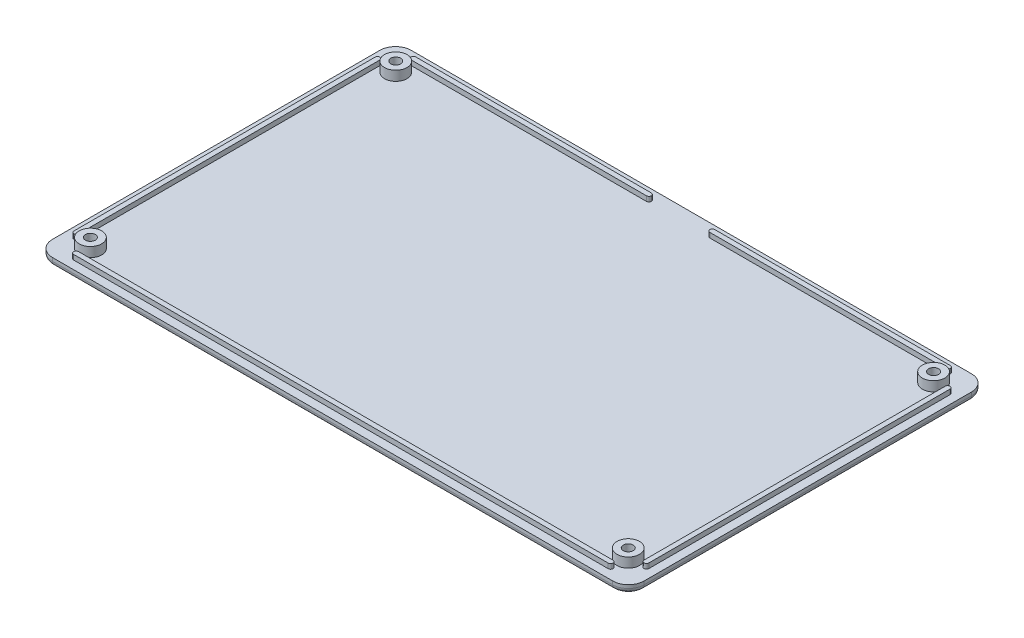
ISO-10303-21;
HEADER;
FILE_DESCRIPTION(('STEP AP214'),'2;1');
FILE_NAME('part.step','',(''),(''),'','','');
FILE_SCHEMA(('AUTOMOTIVE_DESIGN { 1 0 10303 214 1 1 1 1 }'));
ENDSEC;
DATA;
#1=APPLICATION_CONTEXT('core data for automotive mechanical design processes');
#2=APPLICATION_PROTOCOL_DEFINITION('international standard','automotive_design',2000,#1);
#3=PRODUCT_CONTEXT('',#1,'mechanical');
#4=PRODUCT('Part','Part','',(#3));
#5=PRODUCT_RELATED_PRODUCT_CATEGORY('part','',(#4));
#6=PRODUCT_DEFINITION_FORMATION('','',#4);
#7=PRODUCT_DEFINITION_CONTEXT('part definition',#1,'design');
#8=PRODUCT_DEFINITION('design','',#6,#7);
#9=PRODUCT_DEFINITION_SHAPE('','',#8);
#10=(LENGTH_UNIT() NAMED_UNIT(*) SI_UNIT(.MILLI.,.METRE.));
#11=(NAMED_UNIT(*) PLANE_ANGLE_UNIT() SI_UNIT($,.RADIAN.));
#12=(NAMED_UNIT(*) SI_UNIT($,.STERADIAN.) SOLID_ANGLE_UNIT());
#13=UNCERTAINTY_MEASURE_WITH_UNIT(LENGTH_MEASURE(1.E-05),#10,'distance_accuracy_value','');
#14=(GEOMETRIC_REPRESENTATION_CONTEXT(3) GLOBAL_UNCERTAINTY_ASSIGNED_CONTEXT((#13)) GLOBAL_UNIT_ASSIGNED_CONTEXT((#10,
#11,#12)) REPRESENTATION_CONTEXT('',''));
#15=CARTESIAN_POINT('',(0.,0.,0.));
#16=DIRECTION('',(0.,0.,1.));
#17=DIRECTION('',(1.,0.,0.));
#18=AXIS2_PLACEMENT_3D('',#15,#16,#17);
#19=CARTESIAN_POINT('',(-72.6958684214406,-2.413,50.5587));
#20=DIRECTION('',(0.,-1.,0.));
#21=DIRECTION('',(0.,0.,-1.));
#22=AXIS2_PLACEMENT_3D('',#19,#20,#21);
#23=PLANE('',#22);
#24=CARTESIAN_POINT('',(72.6958684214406,-2.413,50.5587));
#25=DIRECTION('',(0.,-1.,0.));
#26=DIRECTION('',(0.,0.,-1.));
#27=AXIS2_PLACEMENT_3D('',#24,#25,#26);
#28=CIRCLE('',#27,4.74979999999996);
#29=CARTESIAN_POINT('',(76.0544842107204,-2.413,53.9173157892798));
#30=VERTEX_POINT('',#29);
#31=CARTESIAN_POINT('',(72.6958684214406,-2.413,55.3085));
#32=VERTEX_POINT('',#31);
#33=EDGE_CURVE('E248',#30,#32,#28,.T.);
#34=ORIENTED_EDGE('',*,*,#33,.T.);
#35=DIRECTION('',(1.,0.,0.));
#36=VECTOR('',#35,1.);
#37=CARTESIAN_POINT('',(-72.6958684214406,-2.413,55.3085));
#38=LINE('',#37,#36);
#39=CARTESIAN_POINT('',(-72.6958684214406,-2.413,55.3085));
#40=VERTEX_POINT('',#39);
#41=EDGE_CURVE('E243',#32,#40,#38,.F.);
#42=ORIENTED_EDGE('',*,*,#41,.T.);
#43=CARTESIAN_POINT('',(-72.6958684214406,-2.413,50.5587));
#44=DIRECTION('',(0.,-1.,0.));
#45=DIRECTION('',(0.,0.,-1.));
#46=AXIS2_PLACEMENT_3D('',#43,#44,#45);
#47=CIRCLE('',#46,4.74979999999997);
#48=CARTESIAN_POINT('',(-76.0544842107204,-2.413,53.9173157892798));
#49=VERTEX_POINT('',#48);
#50=EDGE_CURVE('E208',#40,#49,#47,.T.);
#51=ORIENTED_EDGE('',*,*,#50,.T.);
#52=DIRECTION('',(0.707106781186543,0.,0.707106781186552));
#53=VECTOR('',#52,1.);
#54=CARTESIAN_POINT('',(-92.0808157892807,-2.413,37.8909842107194));
#55=LINE('',#54,#53);
#56=CARTESIAN_POINT('',(-92.0808157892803,-2.413,37.8909842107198));
#57=VERTEX_POINT('',#56);
#58=EDGE_CURVE('E204',#49,#57,#55,.F.);
#59=ORIENTED_EDGE('',*,*,#58,.T.);
#60=CARTESIAN_POINT('',(-88.7222000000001,-2.413,34.5323684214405));
#61=DIRECTION('',(0.,-1.,0.));
#62=DIRECTION('',(0.,0.,-1.));
#63=AXIS2_PLACEMENT_3D('',#60,#61,#62);
#64=CIRCLE('',#63,4.74979999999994);
#65=CARTESIAN_POINT('',(-93.4720000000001,-2.413,34.5323684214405));
#66=VERTEX_POINT('',#65);
#67=EDGE_CURVE('E20',#57,#66,#64,.T.);
#68=ORIENTED_EDGE('',*,*,#67,.T.);
#69=DIRECTION('',(0.,0.,1.));
#70=VECTOR('',#69,1.);
#71=CARTESIAN_POINT('',(-93.4720000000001,-2.413,-34.5323684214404));
#72=LINE('',#71,#70);
#73=CARTESIAN_POINT('',(-93.472,-2.413,-34.5323684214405));
#74=VERTEX_POINT('',#73);
#75=EDGE_CURVE('E303',#66,#74,#72,.F.);
#76=ORIENTED_EDGE('',*,*,#75,.T.);
#77=CARTESIAN_POINT('',(-88.7222000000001,-2.413,-34.5323684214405));
#78=DIRECTION('',(0.,-1.,0.));
#79=DIRECTION('',(0.,0.,-1.));
#80=AXIS2_PLACEMENT_3D('',#77,#78,#79);
#81=CIRCLE('',#80,4.74979999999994);
#82=CARTESIAN_POINT('',(-92.0808157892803,-2.413,-37.8909842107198));
#83=VERTEX_POINT('',#82);
#84=EDGE_CURVE('E298',#74,#83,#81,.T.);
#85=ORIENTED_EDGE('',*,*,#84,.T.);
#86=DIRECTION('',(-0.707106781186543,0.,0.707106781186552));
#87=VECTOR('',#86,1.);
#88=CARTESIAN_POINT('',(-92.0808157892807,-2.413,-37.8909842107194));
#89=LINE('',#88,#87);
#90=CARTESIAN_POINT('',(-76.0544842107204,-2.413,-53.9173157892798));
#91=VERTEX_POINT('',#90);
#92=EDGE_CURVE('E293',#83,#91,#89,.F.);
#93=ORIENTED_EDGE('',*,*,#92,.T.);
#94=CARTESIAN_POINT('',(-72.6958684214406,-2.413,-50.5587));
#95=DIRECTION('',(0.,-1.,0.));
#96=DIRECTION('',(0.,0.,-1.));
#97=AXIS2_PLACEMENT_3D('',#94,#95,#96);
#98=CIRCLE('',#97,4.74979999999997);
#99=CARTESIAN_POINT('',(-72.6958684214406,-2.413,-55.3085));
#100=VERTEX_POINT('',#99);
#101=EDGE_CURVE('E288',#91,#100,#98,.T.);
#102=ORIENTED_EDGE('',*,*,#101,.T.);
#103=DIRECTION('',(-1.,0.,0.));
#104=VECTOR('',#103,1.);
#105=CARTESIAN_POINT('',(-72.6958684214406,-2.413,-55.3085));
#106=LINE('',#105,#104);
#107=CARTESIAN_POINT('',(72.6958684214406,-2.413,-55.3085));
#108=VERTEX_POINT('',#107);
#109=EDGE_CURVE('E283',#100,#108,#106,.F.);
#110=ORIENTED_EDGE('',*,*,#109,.T.);
#111=CARTESIAN_POINT('',(72.6958684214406,-2.413,-50.5587));
#112=DIRECTION('',(0.,-1.,0.));
#113=DIRECTION('',(0.,0.,-1.));
#114=AXIS2_PLACEMENT_3D('',#111,#112,#113);
#115=CIRCLE('',#114,4.74979999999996);
#116=CARTESIAN_POINT('',(76.0544842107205,-2.413,-53.9173157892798));
#117=VERTEX_POINT('',#116);
#118=EDGE_CURVE('E278',#108,#117,#115,.T.);
#119=ORIENTED_EDGE('',*,*,#118,.T.);
#120=DIRECTION('',(-0.707106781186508,0.,-0.707106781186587));
#121=VECTOR('',#120,1.);
#122=CARTESIAN_POINT('',(92.0808157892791,-2.413,-37.8909842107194));
#123=LINE('',#122,#121);
#124=CARTESIAN_POINT('',(92.0808157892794,-2.413,-37.8909842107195));
#125=VERTEX_POINT('',#124);
#126=EDGE_CURVE('E273',#117,#125,#123,.F.);
#127=ORIENTED_EDGE('',*,*,#126,.T.);
#128=CARTESIAN_POINT('',(88.7222,-2.413,-34.5323684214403));
#129=DIRECTION('',(0.,-1.,0.));
#130=DIRECTION('',(0.,0.,-1.));
#131=AXIS2_PLACEMENT_3D('',#128,#129,#130);
#132=CIRCLE('',#131,4.74979999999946);
#133=CARTESIAN_POINT('',(93.472,-2.413,-34.5323684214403));
#134=VERTEX_POINT('',#133);
#135=EDGE_CURVE('E268',#125,#134,#132,.T.);
#136=ORIENTED_EDGE('',*,*,#135,.T.);
#137=DIRECTION('',(0.,0.,-1.));
#138=VECTOR('',#137,1.);
#139=CARTESIAN_POINT('',(93.472,-2.413,-34.5323684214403));
#140=LINE('',#139,#138);
#141=CARTESIAN_POINT('',(93.472,-2.413,34.5323684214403));
#142=VERTEX_POINT('',#141);
#143=EDGE_CURVE('E263',#134,#142,#140,.F.);
#144=ORIENTED_EDGE('',*,*,#143,.T.);
#145=CARTESIAN_POINT('',(88.7222,-2.413,34.5323684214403));
#146=DIRECTION('',(0.,-1.,0.));
#147=DIRECTION('',(0.,0.,-1.));
#148=AXIS2_PLACEMENT_3D('',#145,#146,#147);
#149=CIRCLE('',#148,4.74980000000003);
#150=CARTESIAN_POINT('',(92.0808157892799,-2.413,37.8909842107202));
#151=VERTEX_POINT('',#150);
#152=EDGE_CURVE('E258',#142,#151,#149,.T.);
#153=ORIENTED_EDGE('',*,*,#152,.T.);
#154=DIRECTION('',(0.707106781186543,0.,-0.707106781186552));
#155=VECTOR('',#154,1.);
#156=CARTESIAN_POINT('',(92.0808157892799,-2.413,37.8909842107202));
#157=LINE('',#156,#155);
#158=EDGE_CURVE('E253',#151,#30,#157,.F.);
#159=ORIENTED_EDGE('',*,*,#158,.T.);
#160=EDGE_LOOP('',(#34,#42,#51,#59,#68,#76,#85,#93,#102,#110,#119,#127,#136,#144,#153,#159));
#161=FACE_BOUND('',#160,.T.);
#162=ADVANCED_FACE('F17',(#161),#23,.T.);
#163=CARTESIAN_POINT('',(88.138,-1.12828402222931,-50.038));
#164=DIRECTION('',(0.,-1.,0.));
#165=DIRECTION('',(0.,0.,-1.));
#166=AXIS2_PLACEMENT_3D('',#163,#164,#165);
#167=CONICAL_SURFACE('',#166,3.04799999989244,0.715584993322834);
#168=CARTESIAN_POINT('',(88.138,0.508,-50.038));
#169=DIRECTION('',(0.,-1.,0.));
#170=DIRECTION('',(0.,0.,-1.));
#171=AXIS2_PLACEMENT_3D('',#168,#169,#170);
#172=CIRCLE('',#171,1.6256);
#173=CARTESIAN_POINT('',(88.138,0.508,-51.6636));
#174=VERTEX_POINT('',#173);
#175=EDGE_CURVE('E311',#174,#174,#172,.F.);
#176=ORIENTED_EDGE('',*,*,#175,.T.);
#177=EDGE_LOOP('',(#176));
#178=FACE_BOUND('',#177,.T.);
#179=CARTESIAN_POINT('',(88.138,-1.12828402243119,-50.038));
#180=DIRECTION('',(0.,-1.,0.));
#181=DIRECTION('',(0.,0.,-1.));
#182=AXIS2_PLACEMENT_3D('',#179,#180,#181);
#183=CIRCLE('',#182,3.048);
#184=CARTESIAN_POINT('',(88.138,-1.12828402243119,-53.086));
#185=VERTEX_POINT('',#184);
#186=EDGE_CURVE('E229',#185,#185,#183,.T.);
#187=ORIENTED_EDGE('',*,*,#186,.T.);
#188=EDGE_LOOP('',(#187));
#189=FACE_BOUND('',#188,.T.);
#190=ADVANCED_FACE('F1488',(#178,#189),#167,.F.);
#191=CARTESIAN_POINT('',(-88.138,-1.12828402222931,50.038));
#192=DIRECTION('',(0.,-1.,0.));
#193=DIRECTION('',(0.,0.,-1.));
#194=AXIS2_PLACEMENT_3D('',#191,#192,#193);
#195=CONICAL_SURFACE('',#194,3.04799999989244,0.715584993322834);
#196=CARTESIAN_POINT('',(-88.138,0.508,50.038));
#197=DIRECTION('',(0.,-1.,0.));
#198=DIRECTION('',(0.,0.,-1.));
#199=AXIS2_PLACEMENT_3D('',#196,#197,#198);
#200=CIRCLE('',#199,1.6256);
#201=CARTESIAN_POINT('',(-88.138,0.508,48.4124));
#202=VERTEX_POINT('',#201);
#203=EDGE_CURVE('E306',#202,#202,#200,.F.);
#204=ORIENTED_EDGE('',*,*,#203,.T.);
#205=EDGE_LOOP('',(#204));
#206=FACE_BOUND('',#205,.T.);
#207=CARTESIAN_POINT('',(-88.138,-1.12828402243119,50.038));
#208=DIRECTION('',(0.,-1.,0.));
#209=DIRECTION('',(0.,0.,-1.));
#210=AXIS2_PLACEMENT_3D('',#207,#208,#209);
#211=CIRCLE('',#210,3.048);
#212=CARTESIAN_POINT('',(-88.138,-1.12828402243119,46.99));
#213=VERTEX_POINT('',#212);
#214=EDGE_CURVE('E234',#213,#213,#211,.T.);
#215=ORIENTED_EDGE('',*,*,#214,.T.);
#216=EDGE_LOOP('',(#215));
#217=FACE_BOUND('',#216,.T.);
#218=ADVANCED_FACE('F1486',(#206,#217),#195,.F.);
#219=CARTESIAN_POINT('',(-88.7222000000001,-2.413,34.5323684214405));
#220=DIRECTION('',(0.,-1.,0.));
#221=DIRECTION('',(0.,0.,-1.));
#222=AXIS2_PLACEMENT_3D('',#219,#220,#221);
#223=CYLINDRICAL_SURFACE('',#222,4.74979999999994);
#224=DIRECTION('',(0.,1.,0.));
#225=VECTOR('',#224,1.);
#226=CARTESIAN_POINT('',(-93.4720000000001,-2.413,34.5323684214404));
#227=LINE('',#226,#225);
#228=CARTESIAN_POINT('',(-93.472,-2.667,34.5323684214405));
#229=VERTEX_POINT('',#228);
#230=EDGE_CURVE('E221',#229,#66,#227,.T.);
#231=ORIENTED_EDGE('',*,*,#230,.T.);
#232=ORIENTED_EDGE('',*,*,#67,.F.);
#233=DIRECTION('',(0.,1.,0.));
#234=VECTOR('',#233,1.);
#235=CARTESIAN_POINT('',(-92.0808157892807,-2.413,37.8909842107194));
#236=LINE('',#235,#234);
#237=CARTESIAN_POINT('',(-92.0808157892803,-2.667,37.8909842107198));
#238=VERTEX_POINT('',#237);
#239=EDGE_CURVE('E214',#57,#238,#236,.F.);
#240=ORIENTED_EDGE('',*,*,#239,.T.);
#241=CARTESIAN_POINT('',(-88.7222000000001,-2.667,34.5323684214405));
#242=DIRECTION('',(0.,-1.,0.));
#243=DIRECTION('',(0.,0.,-1.));
#244=AXIS2_PLACEMENT_3D('',#241,#242,#243);
#245=CIRCLE('',#244,4.74979999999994);
#246=EDGE_CURVE('E310',#238,#229,#245,.T.);
#247=ORIENTED_EDGE('',*,*,#246,.T.);
#248=EDGE_LOOP('',(#231,#232,#240,#247));
#249=FACE_BOUND('',#248,.T.);
#250=ADVANCED_FACE('F218',(#249),#223,.F.);
#251=CARTESIAN_POINT('',(-93.4720000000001,-2.413,-34.5323684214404));
#252=DIRECTION('',(-1.,0.,0.));
#253=DIRECTION('',(0.,0.,1.));
#254=AXIS2_PLACEMENT_3D('',#251,#252,#253);
#255=PLANE('',#254);
#256=DIRECTION('',(0.,-1.,0.));
#257=VECTOR('',#256,1.);
#258=CARTESIAN_POINT('',(-93.472,-2.413,-34.5323684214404));
#259=LINE('',#258,#257);
#260=CARTESIAN_POINT('',(-93.472,-2.667,-34.5323684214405));
#261=VERTEX_POINT('',#260);
#262=EDGE_CURVE('E299',#261,#74,#259,.F.);
#263=ORIENTED_EDGE('',*,*,#262,.T.);
#264=ORIENTED_EDGE('',*,*,#75,.F.);
#265=ORIENTED_EDGE('',*,*,#230,.F.);
#266=DIRECTION('',(0.,0.,1.));
#267=VECTOR('',#266,1.);
#268=CARTESIAN_POINT('',(-93.472,-2.667,53.6448));
#269=LINE('',#268,#267);
#270=EDGE_CURVE('E561',#229,#261,#269,.F.);
#271=ORIENTED_EDGE('',*,*,#270,.T.);
#272=EDGE_LOOP('',(#263,#264,#265,#271));
#273=FACE_BOUND('',#272,.T.);
#274=ADVANCED_FACE('F1480',(#273),#255,.F.);
#275=CARTESIAN_POINT('',(-88.7222000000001,-2.413,-34.5323684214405));
#276=DIRECTION('',(0.,-1.,0.));
#277=DIRECTION('',(0.,0.,-1.));
#278=AXIS2_PLACEMENT_3D('',#275,#276,#277);
#279=CYLINDRICAL_SURFACE('',#278,4.74979999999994);
#280=DIRECTION('',(0.,1.,0.));
#281=VECTOR('',#280,1.);
#282=CARTESIAN_POINT('',(-92.0808157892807,-2.413,-37.8909842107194));
#283=LINE('',#282,#281);
#284=CARTESIAN_POINT('',(-92.0808157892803,-2.667,-37.8909842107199));
#285=VERTEX_POINT('',#284);
#286=EDGE_CURVE('E294',#285,#83,#283,.T.);
#287=ORIENTED_EDGE('',*,*,#286,.T.);
#288=ORIENTED_EDGE('',*,*,#84,.F.);
#289=ORIENTED_EDGE('',*,*,#262,.F.);
#290=CARTESIAN_POINT('',(-88.7222000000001,-2.667,-34.5323684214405));
#291=DIRECTION('',(0.,-1.,0.));
#292=DIRECTION('',(0.,0.,-1.));
#293=AXIS2_PLACEMENT_3D('',#290,#291,#292);
#294=CIRCLE('',#293,4.74979999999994);
#295=EDGE_CURVE('E558',#261,#285,#294,.T.);
#296=ORIENTED_EDGE('',*,*,#295,.T.);
#297=EDGE_LOOP('',(#287,#288,#289,#296));
#298=FACE_BOUND('',#297,.T.);
#299=ADVANCED_FACE('F581',(#298),#279,.F.);
#300=CARTESIAN_POINT('',(-92.0808157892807,-2.413,-37.8909842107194));
#301=DIRECTION('',(-0.707106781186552,0.,-0.707106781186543));
#302=DIRECTION('',(-0.707106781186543,0.,0.707106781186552));
#303=AXIS2_PLACEMENT_3D('',#300,#301,#302);
#304=PLANE('',#303);
#305=DIRECTION('',(0.,-1.,0.));
#306=VECTOR('',#305,1.);
#307=CARTESIAN_POINT('',(-76.0544842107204,-2.413,-53.9173157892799));
#308=LINE('',#307,#306);
#309=CARTESIAN_POINT('',(-76.0544842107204,-2.667,-53.9173157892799));
#310=VERTEX_POINT('',#309);
#311=EDGE_CURVE('E289',#310,#91,#308,.F.);
#312=ORIENTED_EDGE('',*,*,#311,.T.);
#313=ORIENTED_EDGE('',*,*,#92,.F.);
#314=ORIENTED_EDGE('',*,*,#286,.F.);
#315=DIRECTION('',(0.707106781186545,0.,-0.70710678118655));
#316=VECTOR('',#315,1.);
#317=CARTESIAN_POINT('',(-92.0808157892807,-2.667,-37.8909842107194));
#318=LINE('',#317,#316);
#319=EDGE_CURVE('E557',#285,#310,#318,.T.);
#320=ORIENTED_EDGE('',*,*,#319,.T.);
#321=EDGE_LOOP('',(#312,#313,#314,#320));
#322=FACE_BOUND('',#321,.T.);
#323=ADVANCED_FACE('F585',(#322),#304,.F.);
#324=CARTESIAN_POINT('',(-72.6958684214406,-2.413,-50.5587));
#325=DIRECTION('',(0.,-1.,0.));
#326=DIRECTION('',(0.,0.,-1.));
#327=AXIS2_PLACEMENT_3D('',#324,#325,#326);
#328=CYLINDRICAL_SURFACE('',#327,4.74979999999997);
#329=DIRECTION('',(0.,1.,0.));
#330=VECTOR('',#329,1.);
#331=CARTESIAN_POINT('',(-72.6958684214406,-2.413,-55.3085));
#332=LINE('',#331,#330);
#333=CARTESIAN_POINT('',(-72.6958684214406,-2.667,-55.3085));
#334=VERTEX_POINT('',#333);
#335=EDGE_CURVE('E284',#334,#100,#332,.T.);
#336=ORIENTED_EDGE('',*,*,#335,.T.);
#337=ORIENTED_EDGE('',*,*,#101,.F.);
#338=ORIENTED_EDGE('',*,*,#311,.F.);
#339=CARTESIAN_POINT('',(-72.6958684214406,-2.667,-50.5587));
#340=DIRECTION('',(0.,-1.,0.));
#341=DIRECTION('',(0.,0.,-1.));
#342=AXIS2_PLACEMENT_3D('',#339,#340,#341);
#343=CIRCLE('',#342,4.74979999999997);
#344=EDGE_CURVE('E554',#310,#334,#343,.T.);
#345=ORIENTED_EDGE('',*,*,#344,.T.);
#346=EDGE_LOOP('',(#336,#337,#338,#345));
#347=FACE_BOUND('',#346,.T.);
#348=ADVANCED_FACE('F590',(#347),#328,.F.);
#349=CARTESIAN_POINT('',(-72.6958684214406,-2.413,-55.3085));
#350=DIRECTION('',(0.,0.,-1.));
#351=DIRECTION('',(-1.,0.,0.));
#352=AXIS2_PLACEMENT_3D('',#349,#350,#351);
#353=PLANE('',#352);
#354=DIRECTION('',(0.,-1.,0.));
#355=VECTOR('',#354,1.);
#356=CARTESIAN_POINT('',(72.6958684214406,-2.413,-55.3085));
#357=LINE('',#356,#355);
#358=CARTESIAN_POINT('',(72.6958684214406,-2.667,-55.3085));
#359=VERTEX_POINT('',#358);
#360=EDGE_CURVE('E279',#359,#108,#357,.F.);
#361=ORIENTED_EDGE('',*,*,#360,.T.);
#362=ORIENTED_EDGE('',*,*,#109,.F.);
#363=ORIENTED_EDGE('',*,*,#335,.F.);
#364=DIRECTION('',(1.,0.,0.));
#365=VECTOR('',#364,1.);
#366=CARTESIAN_POINT('',(-91.8083,-2.667,-55.3085));
#367=LINE('',#366,#365);
#368=EDGE_CURVE('E553',#334,#359,#367,.T.);
#369=ORIENTED_EDGE('',*,*,#368,.T.);
#370=EDGE_LOOP('',(#361,#362,#363,#369));
#371=FACE_BOUND('',#370,.T.);
#372=ADVANCED_FACE('F596',(#371),#353,.F.);
#373=CARTESIAN_POINT('',(72.6958684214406,-2.413,-50.5587));
#374=DIRECTION('',(0.,-1.,0.));
#375=DIRECTION('',(0.,0.,-1.));
#376=AXIS2_PLACEMENT_3D('',#373,#374,#375);
#377=CYLINDRICAL_SURFACE('',#376,4.74979999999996);
#378=DIRECTION('',(0.,1.,0.));
#379=VECTOR('',#378,1.);
#380=CARTESIAN_POINT('',(76.0544842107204,-2.413,-53.9173157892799));
#381=LINE('',#380,#379);
#382=CARTESIAN_POINT('',(76.0544842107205,-2.667,-53.9173157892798));
#383=VERTEX_POINT('',#382);
#384=EDGE_CURVE('E274',#383,#117,#381,.T.);
#385=ORIENTED_EDGE('',*,*,#384,.T.);
#386=ORIENTED_EDGE('',*,*,#118,.F.);
#387=ORIENTED_EDGE('',*,*,#360,.F.);
#388=CARTESIAN_POINT('',(72.6958684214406,-2.667,-50.5587));
#389=DIRECTION('',(0.,-1.,0.));
#390=DIRECTION('',(0.,0.,-1.));
#391=AXIS2_PLACEMENT_3D('',#388,#389,#390);
#392=CIRCLE('',#391,4.74979999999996);
#393=EDGE_CURVE('E550',#359,#383,#392,.T.);
#394=ORIENTED_EDGE('',*,*,#393,.T.);
#395=EDGE_LOOP('',(#385,#386,#387,#394));
#396=FACE_BOUND('',#395,.T.);
#397=ADVANCED_FACE('F600',(#396),#377,.F.);
#398=CARTESIAN_POINT('',(92.0808157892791,-2.413,-37.8909842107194));
#399=DIRECTION('',(0.707106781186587,0.,-0.707106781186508));
#400=DIRECTION('',(-0.707106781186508,0.,-0.707106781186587));
#401=AXIS2_PLACEMENT_3D('',#398,#399,#400);
#402=PLANE('',#401);
#403=DIRECTION('',(0.,-1.,0.));
#404=VECTOR('',#403,1.);
#405=CARTESIAN_POINT('',(92.0808157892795,-2.413,-37.8909842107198));
#406=LINE('',#405,#404);
#407=CARTESIAN_POINT('',(92.0808157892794,-2.667,-37.8909842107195));
#408=VERTEX_POINT('',#407);
#409=EDGE_CURVE('E269',#408,#125,#406,.F.);
#410=ORIENTED_EDGE('',*,*,#409,.T.);
#411=ORIENTED_EDGE('',*,*,#126,.F.);
#412=ORIENTED_EDGE('',*,*,#384,.F.);
#413=DIRECTION('',(0.707106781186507,0.,0.707106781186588));
#414=VECTOR('',#413,1.);
#415=CARTESIAN_POINT('',(76.0544842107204,-2.667,-53.9173157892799));
#416=LINE('',#415,#414);
#417=EDGE_CURVE('E549',#383,#408,#416,.T.);
#418=ORIENTED_EDGE('',*,*,#417,.T.);
#419=EDGE_LOOP('',(#410,#411,#412,#418));
#420=FACE_BOUND('',#419,.T.);
#421=ADVANCED_FACE('F605',(#420),#402,.F.);
#422=CARTESIAN_POINT('',(88.7222,-2.413,-34.5323684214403));
#423=DIRECTION('',(0.,-1.,0.));
#424=DIRECTION('',(0.,0.,-1.));
#425=AXIS2_PLACEMENT_3D('',#422,#423,#424);
#426=CYLINDRICAL_SURFACE('',#425,4.74979999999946);
#427=DIRECTION('',(0.,1.,0.));
#428=VECTOR('',#427,1.);
#429=CARTESIAN_POINT('',(93.472,-2.413,-34.5323684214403));
#430=LINE('',#429,#428);
#431=CARTESIAN_POINT('',(93.4719999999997,-2.667,-34.5323684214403));
#432=VERTEX_POINT('',#431);
#433=EDGE_CURVE('E264',#432,#134,#430,.T.);
#434=ORIENTED_EDGE('',*,*,#433,.T.);
#435=ORIENTED_EDGE('',*,*,#135,.F.);
#436=ORIENTED_EDGE('',*,*,#409,.F.);
#437=CARTESIAN_POINT('',(88.7222,-2.667,-34.5323684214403));
#438=DIRECTION('',(0.,-1.,0.));
#439=DIRECTION('',(0.,0.,-1.));
#440=AXIS2_PLACEMENT_3D('',#437,#438,#439);
#441=CIRCLE('',#440,4.74979999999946);
#442=EDGE_CURVE('E546',#408,#432,#441,.T.);
#443=ORIENTED_EDGE('',*,*,#442,.T.);
#444=EDGE_LOOP('',(#434,#435,#436,#443));
#445=FACE_BOUND('',#444,.T.);
#446=ADVANCED_FACE('F611',(#445),#426,.F.);
#447=CARTESIAN_POINT('',(93.472,-2.413,-34.5323684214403));
#448=DIRECTION('',(1.,0.,0.));
#449=DIRECTION('',(0.,0.,-1.));
#450=AXIS2_PLACEMENT_3D('',#447,#448,#449);
#451=PLANE('',#450);
#452=DIRECTION('',(0.,-1.,0.));
#453=VECTOR('',#452,1.);
#454=CARTESIAN_POINT('',(93.472,-2.413,34.5323684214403));
#455=LINE('',#454,#453);
#456=CARTESIAN_POINT('',(93.4719999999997,-2.667,34.5323684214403));
#457=VERTEX_POINT('',#456);
#458=EDGE_CURVE('E259',#457,#142,#455,.F.);
#459=ORIENTED_EDGE('',*,*,#458,.T.);
#460=ORIENTED_EDGE('',*,*,#143,.F.);
#461=ORIENTED_EDGE('',*,*,#433,.F.);
#462=DIRECTION('',(0.,0.,1.));
#463=VECTOR('',#462,1.);
#464=CARTESIAN_POINT('',(93.4719999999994,-2.667,53.6448));
#465=LINE('',#464,#463);
#466=EDGE_CURVE('E545',#432,#457,#465,.T.);
#467=ORIENTED_EDGE('',*,*,#466,.T.);
#468=EDGE_LOOP('',(#459,#460,#461,#467));
#469=FACE_BOUND('',#468,.T.);
#470=ADVANCED_FACE('F615',(#469),#451,.F.);
#471=CARTESIAN_POINT('',(88.7222,-2.413,34.5323684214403));
#472=DIRECTION('',(0.,-1.,0.));
#473=DIRECTION('',(0.,0.,-1.));
#474=AXIS2_PLACEMENT_3D('',#471,#472,#473);
#475=CYLINDRICAL_SURFACE('',#474,4.74980000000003);
#476=DIRECTION('',(0.,1.,0.));
#477=VECTOR('',#476,1.);
#478=CARTESIAN_POINT('',(92.0808157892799,-2.413,37.8909842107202));
#479=LINE('',#478,#477);
#480=CARTESIAN_POINT('',(92.0808157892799,-2.667,37.8909842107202));
#481=VERTEX_POINT('',#480);
#482=EDGE_CURVE('E254',#481,#151,#479,.T.);
#483=ORIENTED_EDGE('',*,*,#482,.T.);
#484=ORIENTED_EDGE('',*,*,#152,.F.);
#485=ORIENTED_EDGE('',*,*,#458,.F.);
#486=CARTESIAN_POINT('',(88.7222,-2.667,34.5323684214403));
#487=DIRECTION('',(0.,-1.,0.));
#488=DIRECTION('',(0.,0.,-1.));
#489=AXIS2_PLACEMENT_3D('',#486,#487,#488);
#490=CIRCLE('',#489,4.74980000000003);
#491=EDGE_CURVE('E542',#457,#481,#490,.T.);
#492=ORIENTED_EDGE('',*,*,#491,.T.);
#493=EDGE_LOOP('',(#483,#484,#485,#492));
#494=FACE_BOUND('',#493,.T.);
#495=ADVANCED_FACE('F620',(#494),#475,.F.);
#496=CARTESIAN_POINT('',(92.0808157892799,-2.413,37.8909842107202));
#497=DIRECTION('',(0.707106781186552,0.,0.707106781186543));
#498=DIRECTION('',(0.707106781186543,0.,-0.707106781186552));
#499=AXIS2_PLACEMENT_3D('',#496,#497,#498);
#500=PLANE('',#499);
#501=DIRECTION('',(0.,-1.,0.));
#502=VECTOR('',#501,1.);
#503=CARTESIAN_POINT('',(76.0544842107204,-2.413,53.9173157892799));
#504=LINE('',#503,#502);
#505=CARTESIAN_POINT('',(76.0544842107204,-2.667,53.9173157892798));
#506=VERTEX_POINT('',#505);
#507=EDGE_CURVE('E249',#506,#30,#504,.F.);
#508=ORIENTED_EDGE('',*,*,#507,.T.);
#509=ORIENTED_EDGE('',*,*,#158,.F.);
#510=ORIENTED_EDGE('',*,*,#482,.F.);
#511=DIRECTION('',(-0.707106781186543,0.,0.707106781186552));
#512=VECTOR('',#511,1.);
#513=CARTESIAN_POINT('',(92.0808157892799,-2.667,37.8909842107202));
#514=LINE('',#513,#512);
#515=EDGE_CURVE('E541',#481,#506,#514,.T.);
#516=ORIENTED_EDGE('',*,*,#515,.T.);
#517=EDGE_LOOP('',(#508,#509,#510,#516));
#518=FACE_BOUND('',#517,.T.);
#519=ADVANCED_FACE('F626',(#518),#500,.F.);
#520=CARTESIAN_POINT('',(72.6958684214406,-2.413,50.5587));
#521=DIRECTION('',(0.,-1.,0.));
#522=DIRECTION('',(0.,0.,-1.));
#523=AXIS2_PLACEMENT_3D('',#520,#521,#522);
#524=CYLINDRICAL_SURFACE('',#523,4.74979999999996);
#525=DIRECTION('',(0.,1.,0.));
#526=VECTOR('',#525,1.);
#527=CARTESIAN_POINT('',(72.6958684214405,-2.413,55.3085));
#528=LINE('',#527,#526);
#529=CARTESIAN_POINT('',(72.6958684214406,-2.667,55.3085));
#530=VERTEX_POINT('',#529);
#531=EDGE_CURVE('E244',#530,#32,#528,.T.);
#532=ORIENTED_EDGE('',*,*,#531,.T.);
#533=ORIENTED_EDGE('',*,*,#33,.F.);
#534=ORIENTED_EDGE('',*,*,#507,.F.);
#535=CARTESIAN_POINT('',(72.6958684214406,-2.667,50.5587));
#536=DIRECTION('',(0.,-1.,0.));
#537=DIRECTION('',(0.,0.,-1.));
#538=AXIS2_PLACEMENT_3D('',#535,#536,#537);
#539=CIRCLE('',#538,4.74979999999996);
#540=EDGE_CURVE('E538',#506,#530,#539,.T.);
#541=ORIENTED_EDGE('',*,*,#540,.T.);
#542=EDGE_LOOP('',(#532,#533,#534,#541));
#543=FACE_BOUND('',#542,.T.);
#544=ADVANCED_FACE('F630',(#543),#524,.F.);
#545=CARTESIAN_POINT('',(-72.6958684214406,-2.413,55.3085));
#546=DIRECTION('',(0.,0.,1.));
#547=DIRECTION('',(1.,0.,0.));
#548=AXIS2_PLACEMENT_3D('',#545,#546,#547);
#549=PLANE('',#548);
#550=DIRECTION('',(0.,-1.,0.));
#551=VECTOR('',#550,1.);
#552=CARTESIAN_POINT('',(-72.6958684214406,-2.413,55.3085));
#553=LINE('',#552,#551);
#554=CARTESIAN_POINT('',(-72.6958684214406,-2.667,55.3085));
#555=VERTEX_POINT('',#554);
#556=EDGE_CURVE('E239',#555,#40,#553,.F.);
#557=ORIENTED_EDGE('',*,*,#556,.T.);
#558=ORIENTED_EDGE('',*,*,#41,.F.);
#559=ORIENTED_EDGE('',*,*,#531,.F.);
#560=DIRECTION('',(1.,0.,0.));
#561=VECTOR('',#560,1.);
#562=CARTESIAN_POINT('',(-91.8083,-2.667,55.3085));
#563=LINE('',#562,#561);
#564=EDGE_CURVE('E537',#530,#555,#563,.F.);
#565=ORIENTED_EDGE('',*,*,#564,.T.);
#566=EDGE_LOOP('',(#557,#558,#559,#565));
#567=FACE_BOUND('',#566,.T.);
#568=ADVANCED_FACE('F635',(#567),#549,.F.);
#569=CARTESIAN_POINT('',(-72.6958684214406,-2.413,50.5587));
#570=DIRECTION('',(0.,-1.,0.));
#571=DIRECTION('',(0.,0.,-1.));
#572=AXIS2_PLACEMENT_3D('',#569,#570,#571);
#573=CYLINDRICAL_SURFACE('',#572,4.74979999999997);
#574=DIRECTION('',(0.,1.,0.));
#575=VECTOR('',#574,1.);
#576=CARTESIAN_POINT('',(-76.0544842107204,-2.413,53.9173157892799));
#577=LINE('',#576,#575);
#578=CARTESIAN_POINT('',(-76.0544842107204,-2.667,53.9173157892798));
#579=VERTEX_POINT('',#578);
#580=EDGE_CURVE('E215',#579,#49,#577,.T.);
#581=ORIENTED_EDGE('',*,*,#580,.T.);
#582=ORIENTED_EDGE('',*,*,#50,.F.);
#583=ORIENTED_EDGE('',*,*,#556,.F.);
#584=CARTESIAN_POINT('',(-72.6958684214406,-2.667,50.5587));
#585=DIRECTION('',(0.,-1.,0.));
#586=DIRECTION('',(0.,0.,-1.));
#587=AXIS2_PLACEMENT_3D('',#584,#585,#586);
#588=CIRCLE('',#587,4.74979999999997);
#589=EDGE_CURVE('E534',#555,#579,#588,.T.);
#590=ORIENTED_EDGE('',*,*,#589,.T.);
#591=EDGE_LOOP('',(#581,#582,#583,#590));
#592=FACE_BOUND('',#591,.T.);
#593=ADVANCED_FACE('F639',(#592),#573,.F.);
#594=CARTESIAN_POINT('',(-92.0808157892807,-2.413,37.8909842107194));
#595=DIRECTION('',(-0.707106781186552,0.,0.707106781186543));
#596=DIRECTION('',(0.707106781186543,0.,0.707106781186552));
#597=AXIS2_PLACEMENT_3D('',#594,#595,#596);
#598=PLANE('',#597);
#599=ORIENTED_EDGE('',*,*,#239,.F.);
#600=ORIENTED_EDGE('',*,*,#58,.F.);
#601=ORIENTED_EDGE('',*,*,#580,.F.);
#602=DIRECTION('',(-0.707106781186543,0.,-0.707106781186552));
#603=VECTOR('',#602,1.);
#604=CARTESIAN_POINT('',(-76.0544842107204,-2.667,53.9173157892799));
#605=LINE('',#604,#603);
#606=EDGE_CURVE('E226',#579,#238,#605,.T.);
#607=ORIENTED_EDGE('',*,*,#606,.T.);
#608=EDGE_LOOP('',(#599,#600,#601,#607));
#609=FACE_BOUND('',#608,.T.);
#610=ADVANCED_FACE('F224',(#609),#598,.F.);
#611=CARTESIAN_POINT('',(-88.138,3.1242,-50.038));
#612=DIRECTION('',(0.,-1.,0.));
#613=DIRECTION('',(0.,0.,-1.));
#614=AXIS2_PLACEMENT_3D('',#611,#612,#613);
#615=CYLINDRICAL_SURFACE('',#614,3.048);
#616=CARTESIAN_POINT('',(-88.138,-1.12828402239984,-50.038));
#617=DIRECTION('',(0.,-1.,0.));
#618=DIRECTION('',(0.,0.,1.));
#619=AXIS2_PLACEMENT_3D('',#616,#617,#618);
#620=CIRCLE('',#619,3.04800000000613);
#621=CARTESIAN_POINT('',(-88.138,-1.12828402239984,-46.9899999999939));
#622=VERTEX_POINT('',#621);
#623=EDGE_CURVE('E315',#622,#622,#620,.F.);
#624=ORIENTED_EDGE('',*,*,#623,.T.);
#625=EDGE_LOOP('',(#624));
#626=FACE_BOUND('',#625,.T.);
#627=CARTESIAN_POINT('',(-88.138,-2.667,-50.038));
#628=DIRECTION('',(0.,-1.,0.));
#629=DIRECTION('',(0.,0.,-1.));
#630=AXIS2_PLACEMENT_3D('',#627,#628,#629);
#631=CIRCLE('',#630,3.048);
#632=CARTESIAN_POINT('',(-88.138,-2.667,-53.086));
#633=VERTEX_POINT('',#632);
#634=EDGE_CURVE('E530',#633,#633,#631,.T.);
#635=ORIENTED_EDGE('',*,*,#634,.T.);
#636=EDGE_LOOP('',(#635));
#637=FACE_BOUND('',#636,.T.);
#638=ADVANCED_FACE('F1447',(#626,#637),#615,.F.);
#639=CARTESIAN_POINT('',(88.138,3.1242,-50.038));
#640=DIRECTION('',(0.,-1.,0.));
#641=DIRECTION('',(0.,0.,-1.));
#642=AXIS2_PLACEMENT_3D('',#639,#640,#641);
#643=CYLINDRICAL_SURFACE('',#642,3.048);
#644=CARTESIAN_POINT('',(88.138,-2.667,-50.038));
#645=DIRECTION('',(0.,-1.,0.));
#646=DIRECTION('',(0.,0.,-1.));
#647=AXIS2_PLACEMENT_3D('',#644,#645,#646);
#648=CIRCLE('',#647,3.048);
#649=CARTESIAN_POINT('',(88.138,-2.667,-53.086));
#650=VERTEX_POINT('',#649);
#651=EDGE_CURVE('E526',#650,#650,#648,.T.);
#652=ORIENTED_EDGE('',*,*,#651,.T.);
#653=EDGE_LOOP('',(#652));
#654=FACE_BOUND('',#653,.T.);
#655=ORIENTED_EDGE('',*,*,#186,.F.);
#656=EDGE_LOOP('',(#655));
#657=FACE_BOUND('',#656,.T.);
#658=ADVANCED_FACE('F1443',(#654,#657),#643,.F.);
#659=CARTESIAN_POINT('',(-88.138,3.1242,50.038));
#660=DIRECTION('',(0.,-1.,0.));
#661=DIRECTION('',(0.,0.,-1.));
#662=AXIS2_PLACEMENT_3D('',#659,#660,#661);
#663=CYLINDRICAL_SURFACE('',#662,3.048);
#664=CARTESIAN_POINT('',(-88.138,-2.667,50.038));
#665=DIRECTION('',(0.,-1.,0.));
#666=DIRECTION('',(0.,0.,-1.));
#667=AXIS2_PLACEMENT_3D('',#664,#665,#666);
#668=CIRCLE('',#667,3.048);
#669=CARTESIAN_POINT('',(-88.138,-2.667,46.99));
#670=VERTEX_POINT('',#669);
#671=EDGE_CURVE('E522',#670,#670,#668,.T.);
#672=ORIENTED_EDGE('',*,*,#671,.T.);
#673=EDGE_LOOP('',(#672));
#674=FACE_BOUND('',#673,.T.);
#675=ORIENTED_EDGE('',*,*,#214,.F.);
#676=EDGE_LOOP('',(#675));
#677=FACE_BOUND('',#676,.T.);
#678=ADVANCED_FACE('F1439',(#674,#677),#663,.F.);
#679=CARTESIAN_POINT('',(88.138,3.1242,50.038));
#680=DIRECTION('',(0.,-1.,0.));
#681=DIRECTION('',(0.,0.,-1.));
#682=AXIS2_PLACEMENT_3D('',#679,#680,#681);
#683=CYLINDRICAL_SURFACE('',#682,3.048);
#684=CARTESIAN_POINT('',(88.138,-1.12828402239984,50.038));
#685=DIRECTION('',(0.,-1.,0.));
#686=DIRECTION('',(0.,0.,-1.));
#687=AXIS2_PLACEMENT_3D('',#684,#685,#686);
#688=CIRCLE('',#687,3.04800000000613);
#689=CARTESIAN_POINT('',(88.138,-1.12828402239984,46.9899999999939));
#690=VERTEX_POINT('',#689);
#691=EDGE_CURVE('E319',#690,#690,#688,.F.);
#692=ORIENTED_EDGE('',*,*,#691,.T.);
#693=EDGE_LOOP('',(#692));
#694=FACE_BOUND('',#693,.T.);
#695=CARTESIAN_POINT('',(88.138,-2.667,50.038));
#696=DIRECTION('',(0.,-1.,0.));
#697=DIRECTION('',(0.,0.,-1.));
#698=AXIS2_PLACEMENT_3D('',#695,#696,#697);
#699=CIRCLE('',#698,3.048);
#700=CARTESIAN_POINT('',(88.138,-2.667,46.99));
#701=VERTEX_POINT('',#700);
#702=EDGE_CURVE('E517',#701,#701,#699,.T.);
#703=ORIENTED_EDGE('',*,*,#702,.T.);
#704=EDGE_LOOP('',(#703));
#705=FACE_BOUND('',#704,.T.);
#706=ADVANCED_FACE('F1436',(#694,#705),#683,.F.);
#707=CARTESIAN_POINT('',(88.138,-1.12828402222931,50.038));
#708=DIRECTION('',(0.,-1.,0.));
#709=DIRECTION('',(0.,0.,-1.));
#710=AXIS2_PLACEMENT_3D('',#707,#708,#709);
#711=CONICAL_SURFACE('',#710,3.04799999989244,0.715584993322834);
#712=CARTESIAN_POINT('',(88.138,0.508,50.038));
#713=DIRECTION('',(0.,-1.,0.));
#714=DIRECTION('',(0.,0.,-1.));
#715=AXIS2_PLACEMENT_3D('',#712,#713,#714);
#716=CIRCLE('',#715,1.6256);
#717=CARTESIAN_POINT('',(88.138,0.508,48.4124));
#718=VERTEX_POINT('',#717);
#719=EDGE_CURVE('E521',#718,#718,#716,.F.);
#720=ORIENTED_EDGE('',*,*,#719,.T.);
#721=EDGE_LOOP('',(#720));
#722=FACE_BOUND('',#721,.T.);
#723=ORIENTED_EDGE('',*,*,#691,.F.);
#724=EDGE_LOOP('',(#723));
#725=FACE_BOUND('',#724,.T.);
#726=ADVANCED_FACE('F837',(#722,#725),#711,.F.);
#727=CARTESIAN_POINT('',(-88.138,-1.12828402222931,-50.038));
#728=DIRECTION('',(0.,-1.,0.));
#729=DIRECTION('',(0.,0.,-1.));
#730=AXIS2_PLACEMENT_3D('',#727,#728,#729);
#731=CONICAL_SURFACE('',#730,3.04799999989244,0.715584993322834);
#732=CARTESIAN_POINT('',(-88.138,0.508,-50.038));
#733=DIRECTION('',(0.,-1.,0.));
#734=DIRECTION('',(0.,0.,-1.));
#735=AXIS2_PLACEMENT_3D('',#732,#733,#734);
#736=CIRCLE('',#735,1.6256);
#737=CARTESIAN_POINT('',(-88.138,0.508,-51.6636));
#738=VERTEX_POINT('',#737);
#739=EDGE_CURVE('E516',#738,#738,#736,.F.);
#740=ORIENTED_EDGE('',*,*,#739,.T.);
#741=EDGE_LOOP('',(#740));
#742=FACE_BOUND('',#741,.T.);
#743=ORIENTED_EDGE('',*,*,#623,.F.);
#744=EDGE_LOOP('',(#743));
#745=FACE_BOUND('',#744,.T.);
#746=ADVANCED_FACE('F1429',(#742,#745),#731,.F.);
#747=CARTESIAN_POINT('',(88.138,3.1242,-50.038));
#748=DIRECTION('',(0.,-1.,0.));
#749=DIRECTION('',(0.,0.,-1.));
#750=AXIS2_PLACEMENT_3D('',#747,#748,#749);
#751=CYLINDRICAL_SURFACE('',#750,1.6256);
#752=CARTESIAN_POINT('',(88.138,3.175,-50.038));
#753=DIRECTION('',(0.,-1.,0.));
#754=DIRECTION('',(0.,0.,-1.));
#755=AXIS2_PLACEMENT_3D('',#752,#753,#754);
#756=CIRCLE('',#755,1.6256);
#757=CARTESIAN_POINT('',(88.138,3.175,-51.6636));
#758=VERTEX_POINT('',#757);
#759=EDGE_CURVE('E512',#758,#758,#756,.T.);
#760=ORIENTED_EDGE('',*,*,#759,.F.);
#761=EDGE_LOOP('',(#760));
#762=FACE_BOUND('',#761,.T.);
#763=ORIENTED_EDGE('',*,*,#175,.F.);
#764=EDGE_LOOP('',(#763));
#765=FACE_BOUND('',#764,.T.);
#766=ADVANCED_FACE('F1425',(#762,#765),#751,.F.);
#767=CARTESIAN_POINT('',(-88.138,3.1242,50.038));
#768=DIRECTION('',(0.,-1.,0.));
#769=DIRECTION('',(0.,0.,-1.));
#770=AXIS2_PLACEMENT_3D('',#767,#768,#769);
#771=CYLINDRICAL_SURFACE('',#770,1.6256);
#772=CARTESIAN_POINT('',(-88.138,3.175,50.038));
#773=DIRECTION('',(0.,-1.,0.));
#774=DIRECTION('',(0.,0.,-1.));
#775=AXIS2_PLACEMENT_3D('',#772,#773,#774);
#776=CIRCLE('',#775,1.6256);
#777=CARTESIAN_POINT('',(-88.138,3.175,48.4124));
#778=VERTEX_POINT('',#777);
#779=EDGE_CURVE('E508',#778,#778,#776,.T.);
#780=ORIENTED_EDGE('',*,*,#779,.F.);
#781=EDGE_LOOP('',(#780));
#782=FACE_BOUND('',#781,.T.);
#783=ORIENTED_EDGE('',*,*,#203,.F.);
#784=EDGE_LOOP('',(#783));
#785=FACE_BOUND('',#784,.T.);
#786=ADVANCED_FACE('F853',(#782,#785),#771,.F.);
#787=CARTESIAN_POINT('',(-91.8083,-2.667,53.6448));
#788=DIRECTION('',(0.,1.,0.));
#789=DIRECTION('',(0.,0.,1.));
#790=AXIS2_PLACEMENT_3D('',#787,#788,#789);
#791=PLANE('',#790);
#792=CARTESIAN_POINT('',(-91.8083,-2.667,53.6448));
#793=DIRECTION('',(0.,1.,0.));
#794=DIRECTION('',(-1.,0.,0.));
#795=AXIS2_PLACEMENT_3D('',#792,#793,#794);
#796=CIRCLE('',#795,3.5814);
#797=CARTESIAN_POINT('',(-95.3897,-2.667,53.6448));
#798=VERTEX_POINT('',#797);
#799=CARTESIAN_POINT('',(-91.8083,-2.667,57.2262));
#800=VERTEX_POINT('',#799);
#801=EDGE_CURVE('E504',#798,#800,#796,.T.);
#802=ORIENTED_EDGE('',*,*,#801,.F.);
#803=DIRECTION('',(0.,0.,-1.));
#804=VECTOR('',#803,1.);
#805=CARTESIAN_POINT('',(-95.3897,-2.667,-53.6448));
#806=LINE('',#805,#804);
#807=CARTESIAN_POINT('',(-95.3897,-2.667,-53.6448));
#808=VERTEX_POINT('',#807);
#809=EDGE_CURVE('E1141',#808,#798,#806,.F.);
#810=ORIENTED_EDGE('',*,*,#809,.F.);
#811=CARTESIAN_POINT('',(-91.8083,-2.667,-53.6448));
#812=DIRECTION('',(0.,1.,0.));
#813=DIRECTION('',(0.,0.,-1.));
#814=AXIS2_PLACEMENT_3D('',#811,#812,#813);
#815=CIRCLE('',#814,3.58139999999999);
#816=CARTESIAN_POINT('',(-91.8083,-2.667,-57.2262));
#817=VERTEX_POINT('',#816);
#818=EDGE_CURVE('E675',#817,#808,#815,.T.);
#819=ORIENTED_EDGE('',*,*,#818,.F.);
#820=DIRECTION('',(1.,0.,0.));
#821=VECTOR('',#820,1.);
#822=CARTESIAN_POINT('',(91.8083,-2.667,-57.2262));
#823=LINE('',#822,#821);
#824=CARTESIAN_POINT('',(91.8083,-2.667,-57.2262));
#825=VERTEX_POINT('',#824);
#826=EDGE_CURVE('E681',#825,#817,#823,.F.);
#827=ORIENTED_EDGE('',*,*,#826,.F.);
#828=CARTESIAN_POINT('',(91.8083,-2.667,-53.6448));
#829=DIRECTION('',(0.,1.,0.));
#830=DIRECTION('',(1.,0.,0.));
#831=AXIS2_PLACEMENT_3D('',#828,#829,#830);
#832=CIRCLE('',#831,3.5814);
#833=CARTESIAN_POINT('',(95.3897,-2.667,-53.6448));
#834=VERTEX_POINT('',#833);
#835=EDGE_CURVE('E720',#834,#825,#832,.T.);
#836=ORIENTED_EDGE('',*,*,#835,.F.);
#837=DIRECTION('',(0.,0.,1.));
#838=VECTOR('',#837,1.);
#839=CARTESIAN_POINT('',(95.3897,-2.667,-53.6448));
#840=LINE('',#839,#838);
#841=CARTESIAN_POINT('',(95.3897,-2.667,53.6448));
#842=VERTEX_POINT('',#841);
#843=EDGE_CURVE('E747',#842,#834,#840,.F.);
#844=ORIENTED_EDGE('',*,*,#843,.F.);
#845=CARTESIAN_POINT('',(91.8083,-2.667,53.6448));
#846=DIRECTION('',(0.,1.,0.));
#847=DIRECTION('',(0.,0.,1.));
#848=AXIS2_PLACEMENT_3D('',#845,#846,#847);
#849=CIRCLE('',#848,3.58140000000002);
#850=CARTESIAN_POINT('',(91.8083,-2.667,57.2262));
#851=VERTEX_POINT('',#850);
#852=EDGE_CURVE('E766',#851,#842,#849,.T.);
#853=ORIENTED_EDGE('',*,*,#852,.F.);
#854=DIRECTION('',(-1.,0.,0.));
#855=VECTOR('',#854,1.);
#856=CARTESIAN_POINT('',(91.8083,-2.667,57.2262));
#857=LINE('',#856,#855);
#858=EDGE_CURVE('E771',#800,#851,#857,.F.);
#859=ORIENTED_EDGE('',*,*,#858,.F.);
#860=EDGE_LOOP('',(#802,#810,#819,#827,#836,#844,#853,#859));
#861=FACE_BOUND('',#860,.T.);
#862=ORIENTED_EDGE('',*,*,#702,.F.);
#863=EDGE_LOOP('',(#862));
#864=FACE_BOUND('',#863,.T.);
#865=ORIENTED_EDGE('',*,*,#671,.F.);
#866=EDGE_LOOP('',(#865));
#867=FACE_BOUND('',#866,.T.);
#868=ORIENTED_EDGE('',*,*,#651,.F.);
#869=EDGE_LOOP('',(#868));
#870=FACE_BOUND('',#869,.T.);
#871=ORIENTED_EDGE('',*,*,#634,.F.);
#872=EDGE_LOOP('',(#871));
#873=FACE_BOUND('',#872,.T.);
#874=ORIENTED_EDGE('',*,*,#589,.F.);
#875=ORIENTED_EDGE('',*,*,#564,.F.);
#876=ORIENTED_EDGE('',*,*,#540,.F.);
#877=ORIENTED_EDGE('',*,*,#515,.F.);
#878=ORIENTED_EDGE('',*,*,#491,.F.);
#879=ORIENTED_EDGE('',*,*,#466,.F.);
#880=ORIENTED_EDGE('',*,*,#442,.F.);
#881=ORIENTED_EDGE('',*,*,#417,.F.);
#882=ORIENTED_EDGE('',*,*,#393,.F.);
#883=ORIENTED_EDGE('',*,*,#368,.F.);
#884=ORIENTED_EDGE('',*,*,#344,.F.);
#885=ORIENTED_EDGE('',*,*,#319,.F.);
#886=ORIENTED_EDGE('',*,*,#295,.F.);
#887=ORIENTED_EDGE('',*,*,#270,.F.);
#888=ORIENTED_EDGE('',*,*,#246,.F.);
#889=ORIENTED_EDGE('',*,*,#606,.F.);
#890=EDGE_LOOP('',(#874,#875,#876,#877,#878,#879,#880,#881,#882,#883,#884,#885,#886,#887,#888,#889));
#891=FACE_BOUND('',#890,.T.);
#892=ADVANCED_FACE('F644',(#861,#864,#867,#870,#873,#891),#791,.F.);
#893=CARTESIAN_POINT('',(88.138,3.1242,50.038));
#894=DIRECTION('',(0.,-1.,0.));
#895=DIRECTION('',(0.,0.,-1.));
#896=AXIS2_PLACEMENT_3D('',#893,#894,#895);
#897=CYLINDRICAL_SURFACE('',#896,1.6256);
#898=CARTESIAN_POINT('',(88.138,3.175,50.038));
#899=DIRECTION('',(0.,-1.,0.));
#900=DIRECTION('',(0.,0.,-1.));
#901=AXIS2_PLACEMENT_3D('',#898,#899,#900);
#902=CIRCLE('',#901,1.6256);
#903=CARTESIAN_POINT('',(88.138,3.175,48.4124));
#904=VERTEX_POINT('',#903);
#905=EDGE_CURVE('E496',#904,#904,#902,.F.);
#906=ORIENTED_EDGE('',*,*,#905,.T.);
#907=EDGE_LOOP('',(#906));
#908=FACE_BOUND('',#907,.T.);
#909=ORIENTED_EDGE('',*,*,#719,.F.);
#910=EDGE_LOOP('',(#909));
#911=FACE_BOUND('',#910,.T.);
#912=ADVANCED_FACE('F840',(#908,#911),#897,.F.);
#913=CARTESIAN_POINT('',(-88.138,3.1242,-50.038));
#914=DIRECTION('',(0.,-1.,0.));
#915=DIRECTION('',(0.,0.,-1.));
#916=AXIS2_PLACEMENT_3D('',#913,#914,#915);
#917=CYLINDRICAL_SURFACE('',#916,1.6256);
#918=CARTESIAN_POINT('',(-88.138,3.175,-50.038));
#919=DIRECTION('',(0.,-1.,0.));
#920=DIRECTION('',(0.,0.,-1.));
#921=AXIS2_PLACEMENT_3D('',#918,#919,#920);
#922=CIRCLE('',#921,1.6256);
#923=CARTESIAN_POINT('',(-88.138,3.175,-51.6636));
#924=VERTEX_POINT('',#923);
#925=EDGE_CURVE('E492',#924,#924,#922,.F.);
#926=ORIENTED_EDGE('',*,*,#925,.T.);
#927=EDGE_LOOP('',(#926));
#928=FACE_BOUND('',#927,.T.);
#929=ORIENTED_EDGE('',*,*,#739,.F.);
#930=EDGE_LOOP('',(#929));
#931=FACE_BOUND('',#930,.T.);
#932=ADVANCED_FACE('F842',(#928,#931),#917,.F.);
#933=CARTESIAN_POINT('',(88.138,3.175,-50.038));
#934=DIRECTION('',(0.,1.,0.));
#935=DIRECTION('',(0.,0.,1.));
#936=AXIS2_PLACEMENT_3D('',#933,#934,#935);
#937=PLANE('',#936);
#938=CARTESIAN_POINT('',(88.138,3.175,-50.038));
#939=DIRECTION('',(0.,-1.,0.));
#940=DIRECTION('',(0.,0.,-1.));
#941=AXIS2_PLACEMENT_3D('',#938,#939,#940);
#942=CIRCLE('',#941,3.683);
#943=CARTESIAN_POINT('',(88.138,3.175,-53.721));
#944=VERTEX_POINT('',#943);
#945=EDGE_CURVE('E488',#944,#944,#942,.T.);
#946=ORIENTED_EDGE('',*,*,#945,.F.);
#947=EDGE_LOOP('',(#946));
#948=FACE_BOUND('',#947,.T.);
#949=ORIENTED_EDGE('',*,*,#759,.T.);
#950=EDGE_LOOP('',(#949));
#951=FACE_BOUND('',#950,.T.);
#952=ADVANCED_FACE('F850',(#948,#951),#937,.T.);
#953=CARTESIAN_POINT('',(-88.138,3.175,50.038));
#954=DIRECTION('',(0.,1.,0.));
#955=DIRECTION('',(0.,0.,1.));
#956=AXIS2_PLACEMENT_3D('',#953,#954,#955);
#957=PLANE('',#956);
#958=CARTESIAN_POINT('',(-88.138,3.175,50.038));
#959=DIRECTION('',(0.,-1.,0.));
#960=DIRECTION('',(0.,0.,-1.));
#961=AXIS2_PLACEMENT_3D('',#958,#959,#960);
#962=CIRCLE('',#961,3.683);
#963=CARTESIAN_POINT('',(-88.138,3.175,46.355));
#964=VERTEX_POINT('',#963);
#965=EDGE_CURVE('E483',#964,#964,#962,.T.);
#966=ORIENTED_EDGE('',*,*,#965,.F.);
#967=EDGE_LOOP('',(#966));
#968=FACE_BOUND('',#967,.T.);
#969=ORIENTED_EDGE('',*,*,#779,.T.);
#970=EDGE_LOOP('',(#969));
#971=FACE_BOUND('',#970,.T.);
#972=ADVANCED_FACE('F1691',(#968,#971),#957,.T.);
#973=CARTESIAN_POINT('',(-93.4212,1.6002,49.3395));
#974=DIRECTION('',(0.,1.,0.));
#975=DIRECTION('',(0.,0.,1.));
#976=AXIS2_PLACEMENT_3D('',#973,#974,#975);
#977=PLANE('',#976);
#978=CARTESIAN_POINT('',(-93.4212,1.6002,-49.3395));
#979=DIRECTION('',(0.,-1.,0.));
#980=DIRECTION('',(0.,0.,-1.));
#981=AXIS2_PLACEMENT_3D('',#978,#979,#980);
#982=CIRCLE('',#981,0.800099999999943);
#983=CARTESIAN_POINT('',(-92.6211000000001,1.6002,-49.3395));
#984=VERTEX_POINT('',#983);
#985=CARTESIAN_POINT('',(-94.2213,1.6002,-49.3395));
#986=VERTEX_POINT('',#985);
#987=EDGE_CURVE('E505',#984,#986,#982,.F.);
#988=ORIENTED_EDGE('',*,*,#987,.T.);
#989=DIRECTION('',(0.,0.,-1.));
#990=VECTOR('',#989,1.);
#991=CARTESIAN_POINT('',(-94.2213,1.6002,49.3395));
#992=LINE('',#991,#990);
#993=CARTESIAN_POINT('',(-94.2213,1.6002,49.3395));
#994=VERTEX_POINT('',#993);
#995=EDGE_CURVE('E481',#986,#994,#992,.F.);
#996=ORIENTED_EDGE('',*,*,#995,.T.);
#997=CARTESIAN_POINT('',(-93.4212,1.6002,49.3395));
#998=DIRECTION('',(0.,-1.,0.));
#999=DIRECTION('',(0.,0.,-1.));
#1000=AXIS2_PLACEMENT_3D('',#997,#998,#999);
#1001=CIRCLE('',#1000,0.800099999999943);
#1002=CARTESIAN_POINT('',(-92.6211000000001,1.6002,49.3395));
#1003=VERTEX_POINT('',#1002);
#1004=EDGE_CURVE('E477',#1003,#994,#1001,.T.);
#1005=ORIENTED_EDGE('',*,*,#1004,.F.);
#1006=DIRECTION('',(0.,0.,1.));
#1007=VECTOR('',#1006,1.);
#1008=CARTESIAN_POINT('',(-92.6211000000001,1.6002,49.3395));
#1009=LINE('',#1008,#1007);
#1010=EDGE_CURVE('E487',#1003,#984,#1009,.F.);
#1011=ORIENTED_EDGE('',*,*,#1010,.T.);
#1012=EDGE_LOOP('',(#988,#996,#1005,#1011));
#1013=FACE_BOUND('',#1012,.T.);
#1014=ADVANCED_FACE('F1701',(#1013),#977,.T.);
#1015=CARTESIAN_POINT('',(93.4211999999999,1.6002,49.3395));
#1016=DIRECTION('',(0.,1.,0.));
#1017=DIRECTION('',(0.,0.,1.));
#1018=AXIS2_PLACEMENT_3D('',#1015,#1016,#1017);
#1019=PLANE('',#1018);
#1020=CARTESIAN_POINT('',(93.4211999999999,1.6002,-49.3395));
#1021=DIRECTION('',(0.,-1.,0.));
#1022=DIRECTION('',(0.,0.,-1.));
#1023=AXIS2_PLACEMENT_3D('',#1020,#1021,#1022);
#1024=CIRCLE('',#1023,0.800099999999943);
#1025=CARTESIAN_POINT('',(94.2212999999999,1.6002,-49.3395));
#1026=VERTEX_POINT('',#1025);
#1027=CARTESIAN_POINT('',(92.6211,1.6002,-49.3395));
#1028=VERTEX_POINT('',#1027);
#1029=EDGE_CURVE('E501',#1026,#1028,#1024,.F.);
#1030=ORIENTED_EDGE('',*,*,#1029,.T.);
#1031=DIRECTION('',(0.,0.,-1.));
#1032=VECTOR('',#1031,1.);
#1033=CARTESIAN_POINT('',(92.6211,1.6002,49.3395));
#1034=LINE('',#1033,#1032);
#1035=CARTESIAN_POINT('',(92.6211,1.6002,49.3395));
#1036=VERTEX_POINT('',#1035);
#1037=EDGE_CURVE('E475',#1028,#1036,#1034,.F.);
#1038=ORIENTED_EDGE('',*,*,#1037,.T.);
#1039=CARTESIAN_POINT('',(93.4211999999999,1.6002,49.3395));
#1040=DIRECTION('',(0.,-1.,0.));
#1041=DIRECTION('',(0.,0.,-1.));
#1042=AXIS2_PLACEMENT_3D('',#1039,#1040,#1041);
#1043=CIRCLE('',#1042,0.800099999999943);
#1044=CARTESIAN_POINT('',(94.2212999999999,1.6002,49.3395));
#1045=VERTEX_POINT('',#1044);
#1046=EDGE_CURVE('E471',#1045,#1036,#1043,.T.);
#1047=ORIENTED_EDGE('',*,*,#1046,.F.);
#1048=DIRECTION('',(0.,0.,1.));
#1049=VECTOR('',#1048,1.);
#1050=CARTESIAN_POINT('',(94.2212999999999,1.6002,49.3395));
#1051=LINE('',#1050,#1049);
#1052=EDGE_CURVE('E811',#1045,#1026,#1051,.F.);
#1053=ORIENTED_EDGE('',*,*,#1052,.T.);
#1054=EDGE_LOOP('',(#1030,#1038,#1047,#1053));
#1055=FACE_BOUND('',#1054,.T.);
#1056=ADVANCED_FACE('F817',(#1055),#1019,.T.);
#1057=CARTESIAN_POINT('',(-91.8083,-1.0922,53.6448));
#1058=DIRECTION('',(0.,1.,0.));
#1059=DIRECTION('',(0.,0.,1.));
#1060=AXIS2_PLACEMENT_3D('',#1057,#1058,#1059);
#1061=TOROIDAL_SURFACE('',#1060,3.58140000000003,1.5748);
#1062=CARTESIAN_POINT('',(-91.8083,-1.0922,57.2262));
#1063=DIRECTION('',(-1.,0.,0.));
#1064=DIRECTION('',(0.,0.,1.));
#1065=AXIS2_PLACEMENT_3D('',#1062,#1063,#1064);
#1066=CIRCLE('',#1065,1.5748);
#1067=CARTESIAN_POINT('',(-91.8083,-1.0922,58.801));
#1068=VERTEX_POINT('',#1067);
#1069=EDGE_CURVE('E803',#1068,#800,#1066,.F.);
#1070=ORIENTED_EDGE('',*,*,#1069,.F.);
#1071=CARTESIAN_POINT('',(-91.8083,-1.0922,53.6448));
#1072=DIRECTION('',(0.,1.,0.));
#1073=DIRECTION('',(0.,0.,1.));
#1074=AXIS2_PLACEMENT_3D('',#1071,#1072,#1073);
#1075=CIRCLE('',#1074,5.15620000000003);
#1076=CARTESIAN_POINT('',(-96.9645,-1.0922,53.6448));
#1077=VERTEX_POINT('',#1076);
#1078=EDGE_CURVE('E1080',#1077,#1068,#1075,.T.);
#1079=ORIENTED_EDGE('',*,*,#1078,.F.);
#1080=CARTESIAN_POINT('',(-95.3897,-1.0922,53.6448));
#1081=DIRECTION('',(0.,0.,-1.));
#1082=DIRECTION('',(-1.,0.,0.));
#1083=AXIS2_PLACEMENT_3D('',#1080,#1081,#1082);
#1084=CIRCLE('',#1083,1.5748);
#1085=EDGE_CURVE('E500',#798,#1077,#1084,.T.);
#1086=ORIENTED_EDGE('',*,*,#1085,.F.);
#1087=ORIENTED_EDGE('',*,*,#801,.T.);
#1088=EDGE_LOOP('',(#1070,#1079,#1086,#1087));
#1089=FACE_BOUND('',#1088,.T.);
#1090=ADVANCED_FACE('F813',(#1089),#1061,.T.);
#1091=CARTESIAN_POINT('',(91.8083,-1.0922,57.2262));
#1092=DIRECTION('',(-1.,0.,0.));
#1093=DIRECTION('',(0.,0.,1.));
#1094=AXIS2_PLACEMENT_3D('',#1091,#1092,#1093);
#1095=CYLINDRICAL_SURFACE('',#1094,1.5748);
#1096=ORIENTED_EDGE('',*,*,#1069,.T.);
#1097=ORIENTED_EDGE('',*,*,#858,.T.);
#1098=CARTESIAN_POINT('',(91.8083,-1.0922,57.2262));
#1099=DIRECTION('',(1.,0.,0.));
#1100=DIRECTION('',(0.,0.,1.));
#1101=AXIS2_PLACEMENT_3D('',#1098,#1099,#1100);
#1102=CIRCLE('',#1101,1.5748);
#1103=CARTESIAN_POINT('',(91.8083,-1.0922,58.801));
#1104=VERTEX_POINT('',#1103);
#1105=EDGE_CURVE('E790',#1104,#851,#1102,.T.);
#1106=ORIENTED_EDGE('',*,*,#1105,.F.);
#1107=DIRECTION('',(1.,0.,0.));
#1108=VECTOR('',#1107,1.);
#1109=CARTESIAN_POINT('',(91.8083,-1.0922,58.801));
#1110=LINE('',#1109,#1108);
#1111=EDGE_CURVE('E795',#1068,#1104,#1110,.T.);
#1112=ORIENTED_EDGE('',*,*,#1111,.F.);
#1113=EDGE_LOOP('',(#1096,#1097,#1106,#1112));
#1114=FACE_BOUND('',#1113,.T.);
#1115=ADVANCED_FACE('F783',(#1114),#1095,.T.);
#1116=CARTESIAN_POINT('',(91.8083,-1.0922,53.6448));
#1117=DIRECTION('',(0.,1.,0.));
#1118=DIRECTION('',(0.,0.,1.));
#1119=AXIS2_PLACEMENT_3D('',#1116,#1117,#1118);
#1120=TOROIDAL_SURFACE('',#1119,3.58140000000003,1.5748);
#1121=ORIENTED_EDGE('',*,*,#1105,.T.);
#1122=ORIENTED_EDGE('',*,*,#852,.T.);
#1123=CARTESIAN_POINT('',(95.3897,-1.0922,53.6448));
#1124=DIRECTION('',(0.,0.,1.));
#1125=DIRECTION('',(1.,0.,0.));
#1126=AXIS2_PLACEMENT_3D('',#1123,#1124,#1125);
#1127=CIRCLE('',#1126,1.5748);
#1128=CARTESIAN_POINT('',(96.9645,-1.0922,53.6448));
#1129=VERTEX_POINT('',#1128);
#1130=EDGE_CURVE('E756',#1129,#842,#1127,.F.);
#1131=ORIENTED_EDGE('',*,*,#1130,.F.);
#1132=CARTESIAN_POINT('',(91.8083,-1.0922,53.6448));
#1133=DIRECTION('',(0.,1.,0.));
#1134=DIRECTION('',(0.,0.,1.));
#1135=AXIS2_PLACEMENT_3D('',#1132,#1133,#1134);
#1136=CIRCLE('',#1135,5.15620000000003);
#1137=EDGE_CURVE('E1069',#1104,#1129,#1136,.T.);
#1138=ORIENTED_EDGE('',*,*,#1137,.F.);
#1139=EDGE_LOOP('',(#1121,#1122,#1131,#1138));
#1140=FACE_BOUND('',#1139,.T.);
#1141=ADVANCED_FACE('F773',(#1140),#1120,.T.);
#1142=CARTESIAN_POINT('',(95.3897,-1.0922,-53.6448));
#1143=DIRECTION('',(0.,0.,1.));
#1144=DIRECTION('',(1.,0.,0.));
#1145=AXIS2_PLACEMENT_3D('',#1142,#1143,#1144);
#1146=CYLINDRICAL_SURFACE('',#1145,1.5748);
#1147=ORIENTED_EDGE('',*,*,#1130,.T.);
#1148=ORIENTED_EDGE('',*,*,#843,.T.);
#1149=CARTESIAN_POINT('',(95.3897,-1.0922,-53.6448));
#1150=DIRECTION('',(0.,0.,-1.));
#1151=DIRECTION('',(1.,0.,0.));
#1152=AXIS2_PLACEMENT_3D('',#1149,#1150,#1151);
#1153=CIRCLE('',#1152,1.5748);
#1154=CARTESIAN_POINT('',(96.9645,-1.0922,-53.6448));
#1155=VERTEX_POINT('',#1154);
#1156=EDGE_CURVE('E732',#1155,#834,#1153,.T.);
#1157=ORIENTED_EDGE('',*,*,#1156,.F.);
#1158=DIRECTION('',(0.,0.,-1.));
#1159=VECTOR('',#1158,1.);
#1160=CARTESIAN_POINT('',(96.9645,-1.0922,-53.6448));
#1161=LINE('',#1160,#1159);
#1162=EDGE_CURVE('E1062',#1129,#1155,#1161,.T.);
#1163=ORIENTED_EDGE('',*,*,#1162,.F.);
#1164=EDGE_LOOP('',(#1147,#1148,#1157,#1163));
#1165=FACE_BOUND('',#1164,.T.);
#1166=ADVANCED_FACE('F738',(#1165),#1146,.T.);
#1167=CARTESIAN_POINT('',(91.8083,-1.0922,-53.6448));
#1168=DIRECTION('',(0.,1.,0.));
#1169=DIRECTION('',(0.,0.,1.));
#1170=AXIS2_PLACEMENT_3D('',#1167,#1168,#1169);
#1171=TOROIDAL_SURFACE('',#1170,3.5814,1.5748);
#1172=CARTESIAN_POINT('',(91.8083,-1.0922,-57.2262));
#1173=DIRECTION('',(1.,0.,0.));
#1174=DIRECTION('',(0.,0.,-1.));
#1175=AXIS2_PLACEMENT_3D('',#1172,#1173,#1174);
#1176=CIRCLE('',#1175,1.5748);
#1177=CARTESIAN_POINT('',(91.8083,-1.0922,-58.801));
#1178=VERTEX_POINT('',#1177);
#1179=EDGE_CURVE('E716',#1178,#825,#1176,.F.);
#1180=ORIENTED_EDGE('',*,*,#1179,.F.);
#1181=CARTESIAN_POINT('',(91.8083,-1.0922,-53.6448));
#1182=DIRECTION('',(0.,1.,0.));
#1183=DIRECTION('',(0.,0.,1.));
#1184=AXIS2_PLACEMENT_3D('',#1181,#1182,#1183);
#1185=CIRCLE('',#1184,5.1562);
#1186=EDGE_CURVE('E723',#1155,#1178,#1185,.T.);
#1187=ORIENTED_EDGE('',*,*,#1186,.F.);
#1188=ORIENTED_EDGE('',*,*,#1156,.T.);
#1189=ORIENTED_EDGE('',*,*,#835,.T.);
#1190=EDGE_LOOP('',(#1180,#1187,#1188,#1189));
#1191=FACE_BOUND('',#1190,.T.);
#1192=ADVANCED_FACE('F734',(#1191),#1171,.T.);
#1193=CARTESIAN_POINT('',(91.8083,-1.0922,-57.2262));
#1194=DIRECTION('',(1.,0.,0.));
#1195=DIRECTION('',(0.,0.,-1.));
#1196=AXIS2_PLACEMENT_3D('',#1193,#1194,#1195);
#1197=CYLINDRICAL_SURFACE('',#1196,1.5748);
#1198=CARTESIAN_POINT('',(-91.8083,-1.0922,-57.2262));
#1199=DIRECTION('',(-1.,0.,0.));
#1200=DIRECTION('',(0.,0.,-1.));
#1201=AXIS2_PLACEMENT_3D('',#1198,#1199,#1200);
#1202=CIRCLE('',#1201,1.5748);
#1203=CARTESIAN_POINT('',(-91.8083,-1.0922,-58.801));
#1204=VERTEX_POINT('',#1203);
#1205=EDGE_CURVE('E703',#1204,#817,#1202,.T.);
#1206=ORIENTED_EDGE('',*,*,#1205,.F.);
#1207=DIRECTION('',(-1.,0.,0.));
#1208=VECTOR('',#1207,1.);
#1209=CARTESIAN_POINT('',(91.8083,-1.0922,-58.801));
#1210=LINE('',#1209,#1208);
#1211=EDGE_CURVE('E708',#1178,#1204,#1210,.T.);
#1212=ORIENTED_EDGE('',*,*,#1211,.F.);
#1213=ORIENTED_EDGE('',*,*,#1179,.T.);
#1214=ORIENTED_EDGE('',*,*,#826,.T.);
#1215=EDGE_LOOP('',(#1206,#1212,#1213,#1214));
#1216=FACE_BOUND('',#1215,.T.);
#1217=ADVANCED_FACE('F695',(#1216),#1197,.T.);
#1218=CARTESIAN_POINT('',(-91.8083,-1.0922,-53.6448));
#1219=DIRECTION('',(0.,1.,0.));
#1220=DIRECTION('',(0.,0.,1.));
#1221=AXIS2_PLACEMENT_3D('',#1218,#1219,#1220);
#1222=TOROIDAL_SURFACE('',#1221,3.58139999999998,1.5748);
#1223=CARTESIAN_POINT('',(-95.3897,-1.0922,-53.6448));
#1224=DIRECTION('',(0.,0.,-1.));
#1225=DIRECTION('',(-1.,0.,0.));
#1226=AXIS2_PLACEMENT_3D('',#1223,#1224,#1225);
#1227=CIRCLE('',#1226,1.5748);
#1228=CARTESIAN_POINT('',(-96.9645,-1.0922,-53.6448));
#1229=VERTEX_POINT('',#1228);
#1230=EDGE_CURVE('E1144',#1229,#808,#1227,.F.);
#1231=ORIENTED_EDGE('',*,*,#1230,.F.);
#1232=CARTESIAN_POINT('',(-91.8083,-1.0922,-53.6448));
#1233=DIRECTION('',(0.,1.,0.));
#1234=DIRECTION('',(0.,0.,1.));
#1235=AXIS2_PLACEMENT_3D('',#1232,#1233,#1234);
#1236=CIRCLE('',#1235,5.15619999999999);
#1237=EDGE_CURVE('E1040',#1204,#1229,#1236,.T.);
#1238=ORIENTED_EDGE('',*,*,#1237,.F.);
#1239=ORIENTED_EDGE('',*,*,#1205,.T.);
#1240=ORIENTED_EDGE('',*,*,#818,.T.);
#1241=EDGE_LOOP('',(#1231,#1238,#1239,#1240));
#1242=FACE_BOUND('',#1241,.T.);
#1243=ADVANCED_FACE('F683',(#1242),#1222,.T.);
#1244=CARTESIAN_POINT('',(-95.3897,-1.0922,-53.6448));
#1245=DIRECTION('',(0.,0.,-1.));
#1246=DIRECTION('',(-1.,0.,0.));
#1247=AXIS2_PLACEMENT_3D('',#1244,#1245,#1246);
#1248=CYLINDRICAL_SURFACE('',#1247,1.5748);
#1249=ORIENTED_EDGE('',*,*,#1085,.T.);
#1250=DIRECTION('',(0.,0.,1.));
#1251=VECTOR('',#1250,1.);
#1252=CARTESIAN_POINT('',(-96.9645,-1.0922,-53.6448));
#1253=LINE('',#1252,#1251);
#1254=EDGE_CURVE('E1039',#1229,#1077,#1253,.T.);
#1255=ORIENTED_EDGE('',*,*,#1254,.F.);
#1256=ORIENTED_EDGE('',*,*,#1230,.T.);
#1257=ORIENTED_EDGE('',*,*,#809,.T.);
#1258=EDGE_LOOP('',(#1249,#1255,#1256,#1257));
#1259=FACE_BOUND('',#1258,.T.);
#1260=ADVANCED_FACE('F694',(#1259),#1248,.T.);
#1261=CARTESIAN_POINT('',(-87.5919000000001,1.6002,-55.2577000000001));
#1262=DIRECTION('',(0.,1.,0.));
#1263=DIRECTION('',(0.,0.,1.));
#1264=AXIS2_PLACEMENT_3D('',#1261,#1262,#1263);
#1265=PLANE('',#1264);
#1266=CARTESIAN_POINT('',(-10.4013,1.6002,-55.2577000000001));
#1267=DIRECTION('',(0.,-1.,0.));
#1268=DIRECTION('',(0.,0.,-1.));
#1269=AXIS2_PLACEMENT_3D('',#1266,#1267,#1268);
#1270=CIRCLE('',#1269,0.800100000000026);
#1271=CARTESIAN_POINT('',(-10.4013,1.6002,-56.0578000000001));
#1272=VERTEX_POINT('',#1271);
#1273=CARTESIAN_POINT('',(-10.4013,1.6002,-54.4576000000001));
#1274=VERTEX_POINT('',#1273);
#1275=EDGE_CURVE('E459',#1272,#1274,#1270,.T.);
#1276=ORIENTED_EDGE('',*,*,#1275,.F.);
#1277=DIRECTION('',(1.,0.,0.));
#1278=VECTOR('',#1277,1.);
#1279=CARTESIAN_POINT('',(-87.5919000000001,1.6002,-56.0578000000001));
#1280=LINE('',#1279,#1278);
#1281=CARTESIAN_POINT('',(-87.5919000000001,1.6002,-56.0578000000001));
#1282=VERTEX_POINT('',#1281);
#1283=EDGE_CURVE('E469',#1272,#1282,#1280,.F.);
#1284=ORIENTED_EDGE('',*,*,#1283,.T.);
#1285=CARTESIAN_POINT('',(-87.5919000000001,1.6002,-55.2577000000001));
#1286=DIRECTION('',(0.,-1.,0.));
#1287=DIRECTION('',(0.,0.,-1.));
#1288=AXIS2_PLACEMENT_3D('',#1285,#1286,#1287);
#1289=CIRCLE('',#1288,0.800100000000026);
#1290=CARTESIAN_POINT('',(-87.5919000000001,1.6002,-54.4576000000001));
#1291=VERTEX_POINT('',#1290);
#1292=EDGE_CURVE('E465',#1291,#1282,#1289,.T.);
#1293=ORIENTED_EDGE('',*,*,#1292,.F.);
#1294=DIRECTION('',(-1.,0.,0.));
#1295=VECTOR('',#1294,1.);
#1296=CARTESIAN_POINT('',(-87.5919000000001,1.6002,-54.4576000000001));
#1297=LINE('',#1296,#1295);
#1298=EDGE_CURVE('E1015',#1291,#1274,#1297,.F.);
#1299=ORIENTED_EDGE('',*,*,#1298,.T.);
#1300=EDGE_LOOP('',(#1276,#1284,#1293,#1299));
#1301=FACE_BOUND('',#1300,.T.);
#1302=ADVANCED_FACE('F1004',(#1301),#1265,.T.);
#1303=CARTESIAN_POINT('',(-87.5919000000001,1.6002,55.2577));
#1304=DIRECTION('',(0.,1.,0.));
#1305=DIRECTION('',(0.,0.,1.));
#1306=AXIS2_PLACEMENT_3D('',#1303,#1304,#1305);
#1307=PLANE('',#1306);
#1308=CARTESIAN_POINT('',(87.5919,1.6002,55.2577));
#1309=DIRECTION('',(0.,-1.,0.));
#1310=DIRECTION('',(0.,0.,-1.));
#1311=AXIS2_PLACEMENT_3D('',#1308,#1309,#1310);
#1312=CIRCLE('',#1311,0.800099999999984);
#1313=CARTESIAN_POINT('',(87.5919,1.6002,54.4576));
#1314=VERTEX_POINT('',#1313);
#1315=CARTESIAN_POINT('',(87.5919,1.6002,56.0578));
#1316=VERTEX_POINT('',#1315);
#1317=EDGE_CURVE('E443',#1314,#1316,#1312,.T.);
#1318=ORIENTED_EDGE('',*,*,#1317,.F.);
#1319=DIRECTION('',(1.,0.,0.));
#1320=VECTOR('',#1319,1.);
#1321=CARTESIAN_POINT('',(-87.5919000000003,1.6002,54.4576));
#1322=LINE('',#1321,#1320);
#1323=CARTESIAN_POINT('',(-87.5919000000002,1.6002,54.4576));
#1324=VERTEX_POINT('',#1323);
#1325=EDGE_CURVE('E457',#1314,#1324,#1322,.F.);
#1326=ORIENTED_EDGE('',*,*,#1325,.T.);
#1327=CARTESIAN_POINT('',(-87.5919000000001,1.6002,55.2577));
#1328=DIRECTION('',(0.,-1.,0.));
#1329=DIRECTION('',(0.,0.,-1.));
#1330=AXIS2_PLACEMENT_3D('',#1327,#1328,#1329);
#1331=CIRCLE('',#1330,0.800099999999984);
#1332=CARTESIAN_POINT('',(-87.5919000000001,1.6002,56.0578));
#1333=VERTEX_POINT('',#1332);
#1334=EDGE_CURVE('E453',#1333,#1324,#1331,.T.);
#1335=ORIENTED_EDGE('',*,*,#1334,.F.);
#1336=DIRECTION('',(-1.,0.,0.));
#1337=VECTOR('',#1336,1.);
#1338=CARTESIAN_POINT('',(-87.5919000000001,1.6002,56.0578));
#1339=LINE('',#1338,#1337);
#1340=EDGE_CURVE('E1119',#1333,#1316,#1339,.F.);
#1341=ORIENTED_EDGE('',*,*,#1340,.T.);
#1342=EDGE_LOOP('',(#1318,#1326,#1335,#1341));
#1343=FACE_BOUND('',#1342,.T.);
#1344=ADVANCED_FACE('F1001',(#1343),#1307,.T.);
#1345=CARTESIAN_POINT('',(10.4013000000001,1.6002,-55.2577000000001));
#1346=DIRECTION('',(0.,1.,0.));
#1347=DIRECTION('',(0.,0.,1.));
#1348=AXIS2_PLACEMENT_3D('',#1345,#1346,#1347);
#1349=PLANE('',#1348);
#1350=CARTESIAN_POINT('',(87.5919,1.6002,-55.2577000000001));
#1351=DIRECTION('',(0.,-1.,0.));
#1352=DIRECTION('',(0.,0.,-1.));
#1353=AXIS2_PLACEMENT_3D('',#1350,#1351,#1352);
#1354=CIRCLE('',#1353,0.800100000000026);
#1355=CARTESIAN_POINT('',(87.5919,1.6002,-56.0578000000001));
#1356=VERTEX_POINT('',#1355);
#1357=CARTESIAN_POINT('',(87.5919,1.6002,-54.4576000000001));
#1358=VERTEX_POINT('',#1357);
#1359=EDGE_CURVE('E430',#1356,#1358,#1354,.T.);
#1360=ORIENTED_EDGE('',*,*,#1359,.F.);
#1361=DIRECTION('',(1.,0.,0.));
#1362=VECTOR('',#1361,1.);
#1363=CARTESIAN_POINT('',(10.4013000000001,1.6002,-56.0578000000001));
#1364=LINE('',#1363,#1362);
#1365=CARTESIAN_POINT('',(10.4013000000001,1.6002,-56.0578000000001));
#1366=VERTEX_POINT('',#1365);
#1367=EDGE_CURVE('E441',#1356,#1366,#1364,.F.);
#1368=ORIENTED_EDGE('',*,*,#1367,.T.);
#1369=CARTESIAN_POINT('',(10.4013000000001,1.6002,-55.2577000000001));
#1370=DIRECTION('',(0.,-1.,0.));
#1371=DIRECTION('',(0.,0.,-1.));
#1372=AXIS2_PLACEMENT_3D('',#1369,#1370,#1371);
#1373=CIRCLE('',#1372,0.800100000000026);
#1374=CARTESIAN_POINT('',(10.4013000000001,1.6002,-54.4576000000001));
#1375=VERTEX_POINT('',#1374);
#1376=EDGE_CURVE('E437',#1375,#1366,#1373,.T.);
#1377=ORIENTED_EDGE('',*,*,#1376,.F.);
#1378=DIRECTION('',(-1.,0.,0.));
#1379=VECTOR('',#1378,1.);
#1380=CARTESIAN_POINT('',(10.4013000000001,1.6002,-54.4576000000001));
#1381=LINE('',#1380,#1379);
#1382=EDGE_CURVE('E1113',#1375,#1358,#1381,.F.);
#1383=ORIENTED_EDGE('',*,*,#1382,.T.);
#1384=EDGE_LOOP('',(#1360,#1368,#1377,#1383));
#1385=FACE_BOUND('',#1384,.T.);
#1386=ADVANCED_FACE('F997',(#1385),#1349,.T.);
#1387=CARTESIAN_POINT('',(88.138,3.175,50.038));
#1388=DIRECTION('',(0.,-1.,0.));
#1389=DIRECTION('',(0.,0.,-1.));
#1390=AXIS2_PLACEMENT_3D('',#1387,#1388,#1389);
#1391=PLANE('',#1390);
#1392=CARTESIAN_POINT('',(88.138,3.175,50.038));
#1393=DIRECTION('',(0.,-1.,0.));
#1394=DIRECTION('',(0.,0.,-1.));
#1395=AXIS2_PLACEMENT_3D('',#1392,#1393,#1394);
#1396=CIRCLE('',#1395,3.683);
#1397=CARTESIAN_POINT('',(88.138,3.175,46.355));
#1398=VERTEX_POINT('',#1397);
#1399=EDGE_CURVE('E425',#1398,#1398,#1396,.T.);
#1400=ORIENTED_EDGE('',*,*,#1399,.F.);
#1401=EDGE_LOOP('',(#1400));
#1402=FACE_BOUND('',#1401,.T.);
#1403=ORIENTED_EDGE('',*,*,#905,.F.);
#1404=EDGE_LOOP('',(#1403));
#1405=FACE_BOUND('',#1404,.T.);
#1406=ADVANCED_FACE('F993',(#1402,#1405),#1391,.F.);
#1407=CARTESIAN_POINT('',(-88.138,3.175,-50.038));
#1408=DIRECTION('',(0.,-1.,0.));
#1409=DIRECTION('',(0.,0.,-1.));
#1410=AXIS2_PLACEMENT_3D('',#1407,#1408,#1409);
#1411=PLANE('',#1410);
#1412=CARTESIAN_POINT('',(-88.138,3.175,-50.038));
#1413=DIRECTION('',(0.,-1.,0.));
#1414=DIRECTION('',(0.,0.,-1.));
#1415=AXIS2_PLACEMENT_3D('',#1412,#1413,#1414);
#1416=CIRCLE('',#1415,3.683);
#1417=CARTESIAN_POINT('',(-88.138,3.175,-53.721));
#1418=VERTEX_POINT('',#1417);
#1419=EDGE_CURVE('E421',#1418,#1418,#1416,.T.);
#1420=ORIENTED_EDGE('',*,*,#1419,.F.);
#1421=EDGE_LOOP('',(#1420));
#1422=FACE_BOUND('',#1421,.T.);
#1423=ORIENTED_EDGE('',*,*,#925,.F.);
#1424=EDGE_LOOP('',(#1423));
#1425=FACE_BOUND('',#1424,.T.);
#1426=ADVANCED_FACE('F989',(#1422,#1425),#1411,.F.);
#1427=CARTESIAN_POINT('',(88.138,3.175,-50.038));
#1428=DIRECTION('',(0.,-1.,0.));
#1429=DIRECTION('',(0.,0.,-1.));
#1430=AXIS2_PLACEMENT_3D('',#1427,#1428,#1429);
#1431=CYLINDRICAL_SURFACE('',#1430,3.683);
#1432=CARTESIAN_POINT('',(88.138,0.,-50.038));
#1433=DIRECTION('',(0.,-1.,0.));
#1434=DIRECTION('',(0.,0.,-1.));
#1435=AXIS2_PLACEMENT_3D('',#1432,#1433,#1434);
#1436=CIRCLE('',#1435,3.683);
#1437=CARTESIAN_POINT('',(88.138,0.,-53.721));
#1438=VERTEX_POINT('',#1437);
#1439=EDGE_CURVE('E417',#1438,#1438,#1436,.T.);
#1440=ORIENTED_EDGE('',*,*,#1439,.F.);
#1441=EDGE_LOOP('',(#1440));
#1442=FACE_BOUND('',#1441,.T.);
#1443=ORIENTED_EDGE('',*,*,#945,.T.);
#1444=EDGE_LOOP('',(#1443));
#1445=FACE_BOUND('',#1444,.T.);
#1446=ADVANCED_FACE('F985',(#1442,#1445),#1431,.T.);
#1447=CARTESIAN_POINT('',(-88.138,3.175,50.038));
#1448=DIRECTION('',(0.,-1.,0.));
#1449=DIRECTION('',(0.,0.,-1.));
#1450=AXIS2_PLACEMENT_3D('',#1447,#1448,#1449);
#1451=CYLINDRICAL_SURFACE('',#1450,3.683);
#1452=CARTESIAN_POINT('',(-88.138,0.,50.038));
#1453=DIRECTION('',(0.,-1.,0.));
#1454=DIRECTION('',(0.,0.,-1.));
#1455=AXIS2_PLACEMENT_3D('',#1452,#1453,#1454);
#1456=CIRCLE('',#1455,3.683);
#1457=CARTESIAN_POINT('',(-88.138,0.,46.355));
#1458=VERTEX_POINT('',#1457);
#1459=EDGE_CURVE('E413',#1458,#1458,#1456,.T.);
#1460=ORIENTED_EDGE('',*,*,#1459,.F.);
#1461=EDGE_LOOP('',(#1460));
#1462=FACE_BOUND('',#1461,.T.);
#1463=ORIENTED_EDGE('',*,*,#965,.T.);
#1464=EDGE_LOOP('',(#1463));
#1465=FACE_BOUND('',#1464,.T.);
#1466=ADVANCED_FACE('F981',(#1462,#1465),#1451,.T.);
#1467=CARTESIAN_POINT('',(-92.6211000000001,1.6002,49.3395));
#1468=DIRECTION('',(-1.,0.,0.));
#1469=DIRECTION('',(0.,0.,1.));
#1470=AXIS2_PLACEMENT_3D('',#1467,#1468,#1469);
#1471=PLANE('',#1470);
#1472=DIRECTION('',(0.,-1.,0.));
#1473=VECTOR('',#1472,1.);
#1474=CARTESIAN_POINT('',(-92.6211000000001,1.6002,-49.3395));
#1475=LINE('',#1474,#1473);
#1476=CARTESIAN_POINT('',(-92.6211000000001,0.,-49.3395));
#1477=VERTEX_POINT('',#1476);
#1478=EDGE_CURVE('E1098',#984,#1477,#1475,.T.);
#1479=ORIENTED_EDGE('',*,*,#1478,.F.);
#1480=ORIENTED_EDGE('',*,*,#1010,.F.);
#1481=DIRECTION('',(0.,-1.,0.));
#1482=VECTOR('',#1481,1.);
#1483=CARTESIAN_POINT('',(-92.6211000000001,1.6002,49.3395));
#1484=LINE('',#1483,#1482);
#1485=CARTESIAN_POINT('',(-92.6211000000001,0.,49.3395));
#1486=VERTEX_POINT('',#1485);
#1487=EDGE_CURVE('E482',#1486,#1003,#1484,.F.);
#1488=ORIENTED_EDGE('',*,*,#1487,.F.);
#1489=DIRECTION('',(0.,0.,1.));
#1490=VECTOR('',#1489,1.);
#1491=CARTESIAN_POINT('',(-92.6211000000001,0.,53.6448));
#1492=LINE('',#1491,#1490);
#1493=EDGE_CURVE('E412',#1477,#1486,#1492,.T.);
#1494=ORIENTED_EDGE('',*,*,#1493,.F.);
#1495=EDGE_LOOP('',(#1479,#1480,#1488,#1494));
#1496=FACE_BOUND('',#1495,.T.);
#1497=ADVANCED_FACE('F977',(#1496),#1471,.F.);
#1498=CARTESIAN_POINT('',(-93.4212,1.6002,49.3395));
#1499=DIRECTION('',(0.,-1.,0.));
#1500=DIRECTION('',(0.,0.,-1.));
#1501=AXIS2_PLACEMENT_3D('',#1498,#1499,#1500);
#1502=CYLINDRICAL_SURFACE('',#1501,0.800099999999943);
#1503=ORIENTED_EDGE('',*,*,#1004,.T.);
#1504=DIRECTION('',(0.,1.,0.));
#1505=VECTOR('',#1504,1.);
#1506=CARTESIAN_POINT('',(-94.2213,1.6002,49.3395));
#1507=LINE('',#1506,#1505);
#1508=CARTESIAN_POINT('',(-94.2213,0.,49.3395));
#1509=VERTEX_POINT('',#1508);
#1510=EDGE_CURVE('E1106',#994,#1509,#1507,.F.);
#1511=ORIENTED_EDGE('',*,*,#1510,.T.);
#1512=CARTESIAN_POINT('',(-93.4212,0.,49.3395));
#1513=DIRECTION('',(0.,-1.,0.));
#1514=DIRECTION('',(0.,0.,-1.));
#1515=AXIS2_PLACEMENT_3D('',#1512,#1513,#1514);
#1516=CIRCLE('',#1515,0.800099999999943);
#1517=EDGE_CURVE('E408',#1486,#1509,#1516,.T.);
#1518=ORIENTED_EDGE('',*,*,#1517,.F.);
#1519=ORIENTED_EDGE('',*,*,#1487,.T.);
#1520=EDGE_LOOP('',(#1503,#1511,#1518,#1519));
#1521=FACE_BOUND('',#1520,.T.);
#1522=ADVANCED_FACE('F973',(#1521),#1502,.T.);
#1523=CARTESIAN_POINT('',(-94.2213,1.6002,49.3395));
#1524=DIRECTION('',(1.,0.,0.));
#1525=DIRECTION('',(0.,0.,-1.));
#1526=AXIS2_PLACEMENT_3D('',#1523,#1524,#1525);
#1527=PLANE('',#1526);
#1528=ORIENTED_EDGE('',*,*,#1510,.F.);
#1529=ORIENTED_EDGE('',*,*,#995,.F.);
#1530=DIRECTION('',(0.,-1.,0.));
#1531=VECTOR('',#1530,1.);
#1532=CARTESIAN_POINT('',(-94.2213,1.6002,-49.3395));
#1533=LINE('',#1532,#1531);
#1534=CARTESIAN_POINT('',(-94.2213,0.,-49.3395));
#1535=VERTEX_POINT('',#1534);
#1536=EDGE_CURVE('E1102',#1535,#986,#1533,.F.);
#1537=ORIENTED_EDGE('',*,*,#1536,.F.);
#1538=DIRECTION('',(0.,0.,1.));
#1539=VECTOR('',#1538,1.);
#1540=CARTESIAN_POINT('',(-94.2213,0.,53.6448));
#1541=LINE('',#1540,#1539);
#1542=EDGE_CURVE('E407',#1509,#1535,#1541,.F.);
#1543=ORIENTED_EDGE('',*,*,#1542,.F.);
#1544=EDGE_LOOP('',(#1528,#1529,#1537,#1543));
#1545=FACE_BOUND('',#1544,.T.);
#1546=ADVANCED_FACE('F969',(#1545),#1527,.F.);
#1547=CARTESIAN_POINT('',(-93.4212,1.6002,-49.3395));
#1548=DIRECTION('',(0.,-1.,0.));
#1549=DIRECTION('',(0.,0.,-1.));
#1550=AXIS2_PLACEMENT_3D('',#1547,#1548,#1549);
#1551=CYLINDRICAL_SURFACE('',#1550,0.800099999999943);
#1552=ORIENTED_EDGE('',*,*,#1478,.T.);
#1553=CARTESIAN_POINT('',(-93.4212,0.,-49.3395));
#1554=DIRECTION('',(0.,-1.,0.));
#1555=DIRECTION('',(0.,0.,-1.));
#1556=AXIS2_PLACEMENT_3D('',#1553,#1554,#1555);
#1557=CIRCLE('',#1556,0.800099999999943);
#1558=EDGE_CURVE('E403',#1535,#1477,#1557,.T.);
#1559=ORIENTED_EDGE('',*,*,#1558,.F.);
#1560=ORIENTED_EDGE('',*,*,#1536,.T.);
#1561=ORIENTED_EDGE('',*,*,#987,.F.);
#1562=EDGE_LOOP('',(#1552,#1559,#1560,#1561));
#1563=FACE_BOUND('',#1562,.T.);
#1564=ADVANCED_FACE('F965',(#1563),#1551,.T.);
#1565=CARTESIAN_POINT('',(94.2212999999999,1.6002,49.3395));
#1566=DIRECTION('',(-1.,0.,0.));
#1567=DIRECTION('',(0.,0.,1.));
#1568=AXIS2_PLACEMENT_3D('',#1565,#1566,#1567);
#1569=PLANE('',#1568);
#1570=DIRECTION('',(0.,-1.,0.));
#1571=VECTOR('',#1570,1.);
#1572=CARTESIAN_POINT('',(94.2212999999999,1.6002,-49.3395));
#1573=LINE('',#1572,#1571);
#1574=CARTESIAN_POINT('',(94.2212999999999,0.,-49.3395));
#1575=VERTEX_POINT('',#1574);
#1576=EDGE_CURVE('E1083',#1026,#1575,#1573,.T.);
#1577=ORIENTED_EDGE('',*,*,#1576,.F.);
#1578=ORIENTED_EDGE('',*,*,#1052,.F.);
#1579=DIRECTION('',(0.,-1.,0.));
#1580=VECTOR('',#1579,1.);
#1581=CARTESIAN_POINT('',(94.2212999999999,1.6002,49.3395));
#1582=LINE('',#1581,#1580);
#1583=CARTESIAN_POINT('',(94.2212999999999,0.,49.3395));
#1584=VERTEX_POINT('',#1583);
#1585=EDGE_CURVE('E476',#1584,#1045,#1582,.F.);
#1586=ORIENTED_EDGE('',*,*,#1585,.F.);
#1587=DIRECTION('',(0.,0.,1.));
#1588=VECTOR('',#1587,1.);
#1589=CARTESIAN_POINT('',(94.2212999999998,0.,53.6448));
#1590=LINE('',#1589,#1588);
#1591=EDGE_CURVE('E402',#1575,#1584,#1590,.T.);
#1592=ORIENTED_EDGE('',*,*,#1591,.F.);
#1593=EDGE_LOOP('',(#1577,#1578,#1586,#1592));
#1594=FACE_BOUND('',#1593,.T.);
#1595=ADVANCED_FACE('F961',(#1594),#1569,.F.);
#1596=CARTESIAN_POINT('',(93.4211999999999,1.6002,49.3395));
#1597=DIRECTION('',(0.,-1.,0.));
#1598=DIRECTION('',(0.,0.,-1.));
#1599=AXIS2_PLACEMENT_3D('',#1596,#1597,#1598);
#1600=CYLINDRICAL_SURFACE('',#1599,0.800099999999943);
#1601=ORIENTED_EDGE('',*,*,#1046,.T.);
#1602=DIRECTION('',(0.,1.,0.));
#1603=VECTOR('',#1602,1.);
#1604=CARTESIAN_POINT('',(92.6211,1.6002,49.3395));
#1605=LINE('',#1604,#1603);
#1606=CARTESIAN_POINT('',(92.6211,0.,49.3395));
#1607=VERTEX_POINT('',#1606);
#1608=EDGE_CURVE('E1091',#1036,#1607,#1605,.F.);
#1609=ORIENTED_EDGE('',*,*,#1608,.T.);
#1610=CARTESIAN_POINT('',(93.4211999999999,0.,49.3395));
#1611=DIRECTION('',(0.,-1.,0.));
#1612=DIRECTION('',(0.,0.,-1.));
#1613=AXIS2_PLACEMENT_3D('',#1610,#1611,#1612);
#1614=CIRCLE('',#1613,0.800099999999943);
#1615=EDGE_CURVE('E398',#1584,#1607,#1614,.T.);
#1616=ORIENTED_EDGE('',*,*,#1615,.F.);
#1617=ORIENTED_EDGE('',*,*,#1585,.T.);
#1618=EDGE_LOOP('',(#1601,#1609,#1616,#1617));
#1619=FACE_BOUND('',#1618,.T.);
#1620=ADVANCED_FACE('F957',(#1619),#1600,.T.);
#1621=CARTESIAN_POINT('',(92.6211,1.6002,49.3395));
#1622=DIRECTION('',(1.,0.,0.));
#1623=DIRECTION('',(0.,0.,-1.));
#1624=AXIS2_PLACEMENT_3D('',#1621,#1622,#1623);
#1625=PLANE('',#1624);
#1626=ORIENTED_EDGE('',*,*,#1608,.F.);
#1627=ORIENTED_EDGE('',*,*,#1037,.F.);
#1628=DIRECTION('',(0.,-1.,0.));
#1629=VECTOR('',#1628,1.);
#1630=CARTESIAN_POINT('',(92.6211,1.6002,-49.3395));
#1631=LINE('',#1630,#1629);
#1632=CARTESIAN_POINT('',(92.6211,0.,-49.3395));
#1633=VERTEX_POINT('',#1632);
#1634=EDGE_CURVE('E1087',#1633,#1028,#1631,.F.);
#1635=ORIENTED_EDGE('',*,*,#1634,.F.);
#1636=DIRECTION('',(0.,0.,1.));
#1637=VECTOR('',#1636,1.);
#1638=CARTESIAN_POINT('',(92.6211,0.,53.6448));
#1639=LINE('',#1638,#1637);
#1640=EDGE_CURVE('E397',#1607,#1633,#1639,.F.);
#1641=ORIENTED_EDGE('',*,*,#1640,.F.);
#1642=EDGE_LOOP('',(#1626,#1627,#1635,#1641));
#1643=FACE_BOUND('',#1642,.T.);
#1644=ADVANCED_FACE('F953',(#1643),#1625,.F.);
#1645=CARTESIAN_POINT('',(93.4211999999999,1.6002,-49.3395));
#1646=DIRECTION('',(0.,-1.,0.));
#1647=DIRECTION('',(0.,0.,-1.));
#1648=AXIS2_PLACEMENT_3D('',#1645,#1646,#1647);
#1649=CYLINDRICAL_SURFACE('',#1648,0.800099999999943);
#1650=ORIENTED_EDGE('',*,*,#1576,.T.);
#1651=CARTESIAN_POINT('',(93.4211999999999,0.,-49.3395));
#1652=DIRECTION('',(0.,-1.,0.));
#1653=DIRECTION('',(0.,0.,-1.));
#1654=AXIS2_PLACEMENT_3D('',#1651,#1652,#1653);
#1655=CIRCLE('',#1654,0.800099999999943);
#1656=EDGE_CURVE('E393',#1633,#1575,#1655,.T.);
#1657=ORIENTED_EDGE('',*,*,#1656,.F.);
#1658=ORIENTED_EDGE('',*,*,#1634,.T.);
#1659=ORIENTED_EDGE('',*,*,#1029,.F.);
#1660=EDGE_LOOP('',(#1650,#1657,#1658,#1659));
#1661=FACE_BOUND('',#1660,.T.);
#1662=ADVANCED_FACE('F949',(#1661),#1649,.T.);
#1663=CARTESIAN_POINT('',(-91.8083,-2.667,53.6448));
#1664=DIRECTION('',(0.,1.,0.));
#1665=DIRECTION('',(0.,0.,1.));
#1666=AXIS2_PLACEMENT_3D('',#1663,#1664,#1665);
#1667=CYLINDRICAL_SURFACE('',#1666,5.15620000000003);
#1668=DIRECTION('',(0.,1.,0.));
#1669=VECTOR('',#1668,1.);
#1670=CARTESIAN_POINT('',(-91.8083,-2.667,58.801));
#1671=LINE('',#1670,#1669);
#1672=CARTESIAN_POINT('',(-91.8083,0.,58.801));
#1673=VERTEX_POINT('',#1672);
#1674=EDGE_CURVE('E800',#1673,#1068,#1671,.F.);
#1675=ORIENTED_EDGE('',*,*,#1674,.F.);
#1676=CARTESIAN_POINT('',(-91.8083,0.,53.6448));
#1677=DIRECTION('',(0.,1.,0.));
#1678=DIRECTION('',(0.,0.,1.));
#1679=AXIS2_PLACEMENT_3D('',#1676,#1677,#1678);
#1680=CIRCLE('',#1679,5.15620000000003);
#1681=CARTESIAN_POINT('',(-96.9645,0.,53.6448));
#1682=VERTEX_POINT('',#1681);
#1683=EDGE_CURVE('E389',#1682,#1673,#1680,.T.);
#1684=ORIENTED_EDGE('',*,*,#1683,.F.);
#1685=DIRECTION('',(0.,1.,0.));
#1686=VECTOR('',#1685,1.);
#1687=CARTESIAN_POINT('',(-96.9645,-2.667,53.6448));
#1688=LINE('',#1687,#1686);
#1689=EDGE_CURVE('E1043',#1077,#1682,#1688,.T.);
#1690=ORIENTED_EDGE('',*,*,#1689,.F.);
#1691=ORIENTED_EDGE('',*,*,#1078,.T.);
#1692=EDGE_LOOP('',(#1675,#1684,#1690,#1691));
#1693=FACE_BOUND('',#1692,.T.);
#1694=ADVANCED_FACE('F945',(#1693),#1667,.T.);
#1695=CARTESIAN_POINT('',(91.8083,-2.667,58.801));
#1696=DIRECTION('',(0.,0.,1.));
#1697=DIRECTION('',(1.,0.,0.));
#1698=AXIS2_PLACEMENT_3D('',#1695,#1696,#1697);
#1699=PLANE('',#1698);
#1700=DIRECTION('',(0.,1.,0.));
#1701=VECTOR('',#1700,1.);
#1702=CARTESIAN_POINT('',(91.8083,-2.667,58.801));
#1703=LINE('',#1702,#1701);
#1704=CARTESIAN_POINT('',(91.8083,0.,58.801));
#1705=VERTEX_POINT('',#1704);
#1706=EDGE_CURVE('E799',#1705,#1104,#1703,.F.);
#1707=ORIENTED_EDGE('',*,*,#1706,.F.);
#1708=DIRECTION('',(1.,0.,0.));
#1709=VECTOR('',#1708,1.);
#1710=CARTESIAN_POINT('',(-91.8083,0.,58.801));
#1711=LINE('',#1710,#1709);
#1712=EDGE_CURVE('E388',#1673,#1705,#1711,.T.);
#1713=ORIENTED_EDGE('',*,*,#1712,.F.);
#1714=ORIENTED_EDGE('',*,*,#1674,.T.);
#1715=ORIENTED_EDGE('',*,*,#1111,.T.);
#1716=EDGE_LOOP('',(#1707,#1713,#1714,#1715));
#1717=FACE_BOUND('',#1716,.T.);
#1718=ADVANCED_FACE('F941',(#1717),#1699,.T.);
#1719=CARTESIAN_POINT('',(91.8083,-2.667,53.6448));
#1720=DIRECTION('',(0.,1.,0.));
#1721=DIRECTION('',(0.,0.,1.));
#1722=AXIS2_PLACEMENT_3D('',#1719,#1720,#1721);
#1723=CYLINDRICAL_SURFACE('',#1722,5.15620000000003);
#1724=DIRECTION('',(0.,1.,0.));
#1725=VECTOR('',#1724,1.);
#1726=CARTESIAN_POINT('',(96.9645,-2.667,53.6448));
#1727=LINE('',#1726,#1725);
#1728=CARTESIAN_POINT('',(96.9645,0.,53.6448));
#1729=VERTEX_POINT('',#1728);
#1730=EDGE_CURVE('E1065',#1729,#1129,#1727,.F.);
#1731=ORIENTED_EDGE('',*,*,#1730,.F.);
#1732=CARTESIAN_POINT('',(91.8083,0.,53.6448));
#1733=DIRECTION('',(0.,1.,0.));
#1734=DIRECTION('',(0.,0.,1.));
#1735=AXIS2_PLACEMENT_3D('',#1732,#1733,#1734);
#1736=CIRCLE('',#1735,5.15620000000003);
#1737=EDGE_CURVE('E384',#1705,#1729,#1736,.T.);
#1738=ORIENTED_EDGE('',*,*,#1737,.F.);
#1739=ORIENTED_EDGE('',*,*,#1706,.T.);
#1740=ORIENTED_EDGE('',*,*,#1137,.T.);
#1741=EDGE_LOOP('',(#1731,#1738,#1739,#1740));
#1742=FACE_BOUND('',#1741,.T.);
#1743=ADVANCED_FACE('F937',(#1742),#1723,.T.);
#1744=CARTESIAN_POINT('',(96.9645,-2.667,-53.6448));
#1745=DIRECTION('',(1.,0.,0.));
#1746=DIRECTION('',(0.,0.,-1.));
#1747=AXIS2_PLACEMENT_3D('',#1744,#1745,#1746);
#1748=PLANE('',#1747);
#1749=DIRECTION('',(0.,1.,0.));
#1750=VECTOR('',#1749,1.);
#1751=CARTESIAN_POINT('',(96.9645,-2.667,-53.6448));
#1752=LINE('',#1751,#1750);
#1753=CARTESIAN_POINT('',(96.9645,0.,-53.6448));
#1754=VERTEX_POINT('',#1753);
#1755=EDGE_CURVE('E727',#1754,#1155,#1752,.F.);
#1756=ORIENTED_EDGE('',*,*,#1755,.F.);
#1757=DIRECTION('',(0.,0.,1.));
#1758=VECTOR('',#1757,1.);
#1759=CARTESIAN_POINT('',(96.9645,0.,53.6448));
#1760=LINE('',#1759,#1758);
#1761=EDGE_CURVE('E383',#1729,#1754,#1760,.F.);
#1762=ORIENTED_EDGE('',*,*,#1761,.F.);
#1763=ORIENTED_EDGE('',*,*,#1730,.T.);
#1764=ORIENTED_EDGE('',*,*,#1162,.T.);
#1765=EDGE_LOOP('',(#1756,#1762,#1763,#1764));
#1766=FACE_BOUND('',#1765,.T.);
#1767=ADVANCED_FACE('F933',(#1766),#1748,.T.);
#1768=CARTESIAN_POINT('',(91.8083,-2.667,-53.6448));
#1769=DIRECTION('',(0.,1.,0.));
#1770=DIRECTION('',(0.,0.,1.));
#1771=AXIS2_PLACEMENT_3D('',#1768,#1769,#1770);
#1772=CYLINDRICAL_SURFACE('',#1771,5.1562);
#1773=DIRECTION('',(0.,1.,0.));
#1774=VECTOR('',#1773,1.);
#1775=CARTESIAN_POINT('',(91.8083,-2.667,-58.801));
#1776=LINE('',#1775,#1774);
#1777=CARTESIAN_POINT('',(91.8083,0.,-58.801));
#1778=VERTEX_POINT('',#1777);
#1779=EDGE_CURVE('E713',#1778,#1178,#1776,.F.);
#1780=ORIENTED_EDGE('',*,*,#1779,.F.);
#1781=CARTESIAN_POINT('',(91.8083,0.,-53.6448));
#1782=DIRECTION('',(0.,1.,0.));
#1783=DIRECTION('',(0.,0.,1.));
#1784=AXIS2_PLACEMENT_3D('',#1781,#1782,#1783);
#1785=CIRCLE('',#1784,5.1562);
#1786=EDGE_CURVE('E379',#1754,#1778,#1785,.T.);
#1787=ORIENTED_EDGE('',*,*,#1786,.F.);
#1788=ORIENTED_EDGE('',*,*,#1755,.T.);
#1789=ORIENTED_EDGE('',*,*,#1186,.T.);
#1790=EDGE_LOOP('',(#1780,#1787,#1788,#1789));
#1791=FACE_BOUND('',#1790,.T.);
#1792=ADVANCED_FACE('F929',(#1791),#1772,.T.);
#1793=CARTESIAN_POINT('',(91.8083,-2.667,-58.801));
#1794=DIRECTION('',(0.,0.,-1.));
#1795=DIRECTION('',(-1.,0.,0.));
#1796=AXIS2_PLACEMENT_3D('',#1793,#1794,#1795);
#1797=PLANE('',#1796);
#1798=DIRECTION('',(0.,1.,0.));
#1799=VECTOR('',#1798,1.);
#1800=CARTESIAN_POINT('',(-91.8083,-2.667,-58.801));
#1801=LINE('',#1800,#1799);
#1802=CARTESIAN_POINT('',(-91.8083,0.,-58.801));
#1803=VERTEX_POINT('',#1802);
#1804=EDGE_CURVE('E712',#1803,#1204,#1801,.F.);
#1805=ORIENTED_EDGE('',*,*,#1804,.F.);
#1806=DIRECTION('',(1.,0.,0.));
#1807=VECTOR('',#1806,1.);
#1808=CARTESIAN_POINT('',(-91.8083,0.,-58.801));
#1809=LINE('',#1808,#1807);
#1810=EDGE_CURVE('E378',#1778,#1803,#1809,.F.);
#1811=ORIENTED_EDGE('',*,*,#1810,.F.);
#1812=ORIENTED_EDGE('',*,*,#1779,.T.);
#1813=ORIENTED_EDGE('',*,*,#1211,.T.);
#1814=EDGE_LOOP('',(#1805,#1811,#1812,#1813));
#1815=FACE_BOUND('',#1814,.T.);
#1816=ADVANCED_FACE('F925',(#1815),#1797,.T.);
#1817=CARTESIAN_POINT('',(-91.8083,-2.667,-53.6448));
#1818=DIRECTION('',(0.,1.,0.));
#1819=DIRECTION('',(0.,0.,1.));
#1820=AXIS2_PLACEMENT_3D('',#1817,#1818,#1819);
#1821=CYLINDRICAL_SURFACE('',#1820,5.15619999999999);
#1822=DIRECTION('',(0.,1.,0.));
#1823=VECTOR('',#1822,1.);
#1824=CARTESIAN_POINT('',(-96.9645,-2.667,-53.6448));
#1825=LINE('',#1824,#1823);
#1826=CARTESIAN_POINT('',(-96.9645,0.,-53.6448));
#1827=VERTEX_POINT('',#1826);
#1828=EDGE_CURVE('E1035',#1827,#1229,#1825,.F.);
#1829=ORIENTED_EDGE('',*,*,#1828,.F.);
#1830=CARTESIAN_POINT('',(-91.8083,0.,-53.6448));
#1831=DIRECTION('',(0.,1.,0.));
#1832=DIRECTION('',(0.,0.,1.));
#1833=AXIS2_PLACEMENT_3D('',#1830,#1831,#1832);
#1834=CIRCLE('',#1833,5.15619999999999);
#1835=EDGE_CURVE('E373',#1803,#1827,#1834,.T.);
#1836=ORIENTED_EDGE('',*,*,#1835,.F.);
#1837=ORIENTED_EDGE('',*,*,#1804,.T.);
#1838=ORIENTED_EDGE('',*,*,#1237,.T.);
#1839=EDGE_LOOP('',(#1829,#1836,#1837,#1838));
#1840=FACE_BOUND('',#1839,.T.);
#1841=ADVANCED_FACE('F921',(#1840),#1821,.T.);
#1842=CARTESIAN_POINT('',(-96.9645,-2.667,-53.6448));
#1843=DIRECTION('',(-1.,0.,0.));
#1844=DIRECTION('',(0.,0.,1.));
#1845=AXIS2_PLACEMENT_3D('',#1842,#1843,#1844);
#1846=PLANE('',#1845);
#1847=ORIENTED_EDGE('',*,*,#1689,.T.);
#1848=DIRECTION('',(0.,0.,1.));
#1849=VECTOR('',#1848,1.);
#1850=CARTESIAN_POINT('',(-96.9645,0.,53.6448));
#1851=LINE('',#1850,#1849);
#1852=EDGE_CURVE('E377',#1827,#1682,#1851,.T.);
#1853=ORIENTED_EDGE('',*,*,#1852,.F.);
#1854=ORIENTED_EDGE('',*,*,#1828,.T.);
#1855=ORIENTED_EDGE('',*,*,#1254,.T.);
#1856=EDGE_LOOP('',(#1847,#1853,#1854,#1855));
#1857=FACE_BOUND('',#1856,.T.);
#1858=ADVANCED_FACE('F917',(#1857),#1846,.T.);
#1859=CARTESIAN_POINT('',(-87.5919000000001,1.6002,-54.4576000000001));
#1860=DIRECTION('',(0.,0.,-1.));
#1861=DIRECTION('',(-1.,0.,0.));
#1862=AXIS2_PLACEMENT_3D('',#1859,#1860,#1861);
#1863=PLANE('',#1862);
#1864=DIRECTION('',(0.,-1.,0.));
#1865=VECTOR('',#1864,1.);
#1866=CARTESIAN_POINT('',(-10.4013,1.6002,-54.4576000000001));
#1867=LINE('',#1866,#1865);
#1868=CARTESIAN_POINT('',(-10.4013,0.,-54.4576000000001));
#1869=VERTEX_POINT('',#1868);
#1870=EDGE_CURVE('E463',#1274,#1869,#1867,.T.);
#1871=ORIENTED_EDGE('',*,*,#1870,.F.);
#1872=ORIENTED_EDGE('',*,*,#1298,.F.);
#1873=DIRECTION('',(0.,-1.,0.));
#1874=VECTOR('',#1873,1.);
#1875=CARTESIAN_POINT('',(-87.5919000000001,1.6002,-54.4576000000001));
#1876=LINE('',#1875,#1874);
#1877=CARTESIAN_POINT('',(-87.5919000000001,0.,-54.4576000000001));
#1878=VERTEX_POINT('',#1877);
#1879=EDGE_CURVE('E470',#1878,#1291,#1876,.F.);
#1880=ORIENTED_EDGE('',*,*,#1879,.F.);
#1881=DIRECTION('',(1.,0.,0.));
#1882=VECTOR('',#1881,1.);
#1883=CARTESIAN_POINT('',(-91.8083,0.,-54.4576000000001));
#1884=LINE('',#1883,#1882);
#1885=EDGE_CURVE('E372',#1869,#1878,#1884,.F.);
#1886=ORIENTED_EDGE('',*,*,#1885,.F.);
#1887=EDGE_LOOP('',(#1871,#1872,#1880,#1886));
#1888=FACE_BOUND('',#1887,.T.);
#1889=ADVANCED_FACE('F913',(#1888),#1863,.F.);
#1890=CARTESIAN_POINT('',(-87.5919000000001,1.6002,-55.2577000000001));
#1891=DIRECTION('',(0.,-1.,0.));
#1892=DIRECTION('',(0.,0.,-1.));
#1893=AXIS2_PLACEMENT_3D('',#1890,#1891,#1892);
#1894=CYLINDRICAL_SURFACE('',#1893,0.800100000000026);
#1895=ORIENTED_EDGE('',*,*,#1292,.T.);
#1896=DIRECTION('',(0.,1.,0.));
#1897=VECTOR('',#1896,1.);
#1898=CARTESIAN_POINT('',(-87.5919000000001,1.6002,-56.0578000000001));
#1899=LINE('',#1898,#1897);
#1900=CARTESIAN_POINT('',(-87.5919000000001,0.,-56.0578000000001));
#1901=VERTEX_POINT('',#1900);
#1902=EDGE_CURVE('E1024',#1282,#1901,#1899,.F.);
#1903=ORIENTED_EDGE('',*,*,#1902,.T.);
#1904=CARTESIAN_POINT('',(-87.5919000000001,0.,-55.2577000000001));
#1905=DIRECTION('',(0.,-1.,0.));
#1906=DIRECTION('',(0.,0.,-1.));
#1907=AXIS2_PLACEMENT_3D('',#1904,#1905,#1906);
#1908=CIRCLE('',#1907,0.800100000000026);
#1909=EDGE_CURVE('E368',#1878,#1901,#1908,.T.);
#1910=ORIENTED_EDGE('',*,*,#1909,.F.);
#1911=ORIENTED_EDGE('',*,*,#1879,.T.);
#1912=EDGE_LOOP('',(#1895,#1903,#1910,#1911));
#1913=FACE_BOUND('',#1912,.T.);
#1914=ADVANCED_FACE('F909',(#1913),#1894,.T.);
#1915=CARTESIAN_POINT('',(-87.5919000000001,1.6002,-56.0578000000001));
#1916=DIRECTION('',(0.,0.,1.));
#1917=DIRECTION('',(1.,0.,0.));
#1918=AXIS2_PLACEMENT_3D('',#1915,#1916,#1917);
#1919=PLANE('',#1918);
#1920=ORIENTED_EDGE('',*,*,#1902,.F.);
#1921=ORIENTED_EDGE('',*,*,#1283,.F.);
#1922=DIRECTION('',(0.,-1.,0.));
#1923=VECTOR('',#1922,1.);
#1924=CARTESIAN_POINT('',(-10.4013,1.6002,-56.0578000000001));
#1925=LINE('',#1924,#1923);
#1926=CARTESIAN_POINT('',(-10.4013,0.,-56.0578000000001));
#1927=VERTEX_POINT('',#1926);
#1928=EDGE_CURVE('E464',#1927,#1272,#1925,.F.);
#1929=ORIENTED_EDGE('',*,*,#1928,.F.);
#1930=DIRECTION('',(1.,0.,0.));
#1931=VECTOR('',#1930,1.);
#1932=CARTESIAN_POINT('',(-91.8083,0.,-56.0578000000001));
#1933=LINE('',#1932,#1931);
#1934=EDGE_CURVE('E367',#1901,#1927,#1933,.T.);
#1935=ORIENTED_EDGE('',*,*,#1934,.F.);
#1936=EDGE_LOOP('',(#1920,#1921,#1929,#1935));
#1937=FACE_BOUND('',#1936,.T.);
#1938=ADVANCED_FACE('F905',(#1937),#1919,.F.);
#1939=CARTESIAN_POINT('',(-10.4013,1.6002,-55.2577000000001));
#1940=DIRECTION('',(0.,-1.,0.));
#1941=DIRECTION('',(0.,0.,-1.));
#1942=AXIS2_PLACEMENT_3D('',#1939,#1940,#1941);
#1943=CYLINDRICAL_SURFACE('',#1942,0.800100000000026);
#1944=ORIENTED_EDGE('',*,*,#1275,.T.);
#1945=ORIENTED_EDGE('',*,*,#1870,.T.);
#1946=CARTESIAN_POINT('',(-10.4013,0.,-55.2577000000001));
#1947=DIRECTION('',(0.,-1.,0.));
#1948=DIRECTION('',(0.,0.,-1.));
#1949=AXIS2_PLACEMENT_3D('',#1946,#1947,#1948);
#1950=CIRCLE('',#1949,0.800100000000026);
#1951=EDGE_CURVE('E363',#1927,#1869,#1950,.T.);
#1952=ORIENTED_EDGE('',*,*,#1951,.F.);
#1953=ORIENTED_EDGE('',*,*,#1928,.T.);
#1954=EDGE_LOOP('',(#1944,#1945,#1952,#1953));
#1955=FACE_BOUND('',#1954,.T.);
#1956=ADVANCED_FACE('F901',(#1955),#1943,.T.);
#1957=CARTESIAN_POINT('',(-87.5919000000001,1.6002,56.0578));
#1958=DIRECTION('',(0.,0.,-1.));
#1959=DIRECTION('',(-1.,0.,0.));
#1960=AXIS2_PLACEMENT_3D('',#1957,#1958,#1959);
#1961=PLANE('',#1960);
#1962=DIRECTION('',(0.,-1.,0.));
#1963=VECTOR('',#1962,1.);
#1964=CARTESIAN_POINT('',(87.5919,1.6002,56.0578));
#1965=LINE('',#1964,#1963);
#1966=CARTESIAN_POINT('',(87.5918999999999,0.,56.0578));
#1967=VERTEX_POINT('',#1966);
#1968=EDGE_CURVE('E447',#1316,#1967,#1965,.T.);
#1969=ORIENTED_EDGE('',*,*,#1968,.F.);
#1970=ORIENTED_EDGE('',*,*,#1340,.F.);
#1971=DIRECTION('',(0.,-1.,0.));
#1972=VECTOR('',#1971,1.);
#1973=CARTESIAN_POINT('',(-87.5919000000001,1.6002,56.0578));
#1974=LINE('',#1973,#1972);
#1975=CARTESIAN_POINT('',(-87.5919000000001,0.,56.0578));
#1976=VERTEX_POINT('',#1975);
#1977=EDGE_CURVE('E458',#1976,#1333,#1974,.F.);
#1978=ORIENTED_EDGE('',*,*,#1977,.F.);
#1979=DIRECTION('',(1.,0.,0.));
#1980=VECTOR('',#1979,1.);
#1981=CARTESIAN_POINT('',(-91.8083,0.,56.0578));
#1982=LINE('',#1981,#1980);
#1983=EDGE_CURVE('E362',#1967,#1976,#1982,.F.);
#1984=ORIENTED_EDGE('',*,*,#1983,.F.);
#1985=EDGE_LOOP('',(#1969,#1970,#1978,#1984));
#1986=FACE_BOUND('',#1985,.T.);
#1987=ADVANCED_FACE('F897',(#1986),#1961,.F.);
#1988=CARTESIAN_POINT('',(-87.5919000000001,1.6002,55.2577));
#1989=DIRECTION('',(0.,-1.,0.));
#1990=DIRECTION('',(0.,0.,-1.));
#1991=AXIS2_PLACEMENT_3D('',#1988,#1989,#1990);
#1992=CYLINDRICAL_SURFACE('',#1991,0.800099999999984);
#1993=ORIENTED_EDGE('',*,*,#1334,.T.);
#1994=DIRECTION('',(0.,1.,0.));
#1995=VECTOR('',#1994,1.);
#1996=CARTESIAN_POINT('',(-87.5919000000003,1.6002,54.4576));
#1997=LINE('',#1996,#1995);
#1998=CARTESIAN_POINT('',(-87.5919000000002,0.,54.4576));
#1999=VERTEX_POINT('',#1998);
#2000=EDGE_CURVE('E452',#1324,#1999,#1997,.F.);
#2001=ORIENTED_EDGE('',*,*,#2000,.T.);
#2002=CARTESIAN_POINT('',(-87.5919000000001,0.,55.2577));
#2003=DIRECTION('',(0.,-1.,0.));
#2004=DIRECTION('',(0.,0.,-1.));
#2005=AXIS2_PLACEMENT_3D('',#2002,#2003,#2004);
#2006=CIRCLE('',#2005,0.800099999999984);
#2007=EDGE_CURVE('E358',#1976,#1999,#2006,.T.);
#2008=ORIENTED_EDGE('',*,*,#2007,.F.);
#2009=ORIENTED_EDGE('',*,*,#1977,.T.);
#2010=EDGE_LOOP('',(#1993,#2001,#2008,#2009));
#2011=FACE_BOUND('',#2010,.T.);
#2012=ADVANCED_FACE('F893',(#2011),#1992,.T.);
#2013=CARTESIAN_POINT('',(-87.5919000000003,1.6002,54.4576));
#2014=DIRECTION('',(0.,0.,1.));
#2015=DIRECTION('',(1.,0.,0.));
#2016=AXIS2_PLACEMENT_3D('',#2013,#2014,#2015);
#2017=PLANE('',#2016);
#2018=ORIENTED_EDGE('',*,*,#2000,.F.);
#2019=ORIENTED_EDGE('',*,*,#1325,.F.);
#2020=DIRECTION('',(0.,1.,0.));
#2021=VECTOR('',#2020,1.);
#2022=CARTESIAN_POINT('',(87.5919,1.6002,54.4576));
#2023=LINE('',#2022,#2021);
#2024=CARTESIAN_POINT('',(87.5919,0.,54.4576));
#2025=VERTEX_POINT('',#2024);
#2026=EDGE_CURVE('E448',#2025,#1314,#2023,.T.);
#2027=ORIENTED_EDGE('',*,*,#2026,.F.);
#2028=DIRECTION('',(1.,0.,0.));
#2029=VECTOR('',#2028,1.);
#2030=CARTESIAN_POINT('',(-91.8083,0.,54.4576));
#2031=LINE('',#2030,#2029);
#2032=EDGE_CURVE('E357',#1999,#2025,#2031,.T.);
#2033=ORIENTED_EDGE('',*,*,#2032,.F.);
#2034=EDGE_LOOP('',(#2018,#2019,#2027,#2033));
#2035=FACE_BOUND('',#2034,.T.);
#2036=ADVANCED_FACE('F889',(#2035),#2017,.F.);
#2037=CARTESIAN_POINT('',(87.5919,1.6002,55.2577));
#2038=DIRECTION('',(0.,-1.,0.));
#2039=DIRECTION('',(0.,0.,-1.));
#2040=AXIS2_PLACEMENT_3D('',#2037,#2038,#2039);
#2041=CYLINDRICAL_SURFACE('',#2040,0.800099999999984);
#2042=ORIENTED_EDGE('',*,*,#1317,.T.);
#2043=ORIENTED_EDGE('',*,*,#1968,.T.);
#2044=CARTESIAN_POINT('',(87.5919,0.,55.2577));
#2045=DIRECTION('',(0.,-1.,0.));
#2046=DIRECTION('',(0.,0.,-1.));
#2047=AXIS2_PLACEMENT_3D('',#2044,#2045,#2046);
#2048=CIRCLE('',#2047,0.800099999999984);
#2049=EDGE_CURVE('E353',#2025,#1967,#2048,.T.);
#2050=ORIENTED_EDGE('',*,*,#2049,.F.);
#2051=ORIENTED_EDGE('',*,*,#2026,.T.);
#2052=EDGE_LOOP('',(#2042,#2043,#2050,#2051));
#2053=FACE_BOUND('',#2052,.T.);
#2054=ADVANCED_FACE('F885',(#2053),#2041,.T.);
#2055=CARTESIAN_POINT('',(10.4013000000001,1.6002,-54.4576000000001));
#2056=DIRECTION('',(0.,0.,-1.));
#2057=DIRECTION('',(-1.,0.,0.));
#2058=AXIS2_PLACEMENT_3D('',#2055,#2056,#2057);
#2059=PLANE('',#2058);
#2060=DIRECTION('',(0.,-1.,0.));
#2061=VECTOR('',#2060,1.);
#2062=CARTESIAN_POINT('',(87.5919,1.6002,-54.4576000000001));
#2063=LINE('',#2062,#2061);
#2064=CARTESIAN_POINT('',(87.5918999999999,0.,-54.4576000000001));
#2065=VERTEX_POINT('',#2064);
#2066=EDGE_CURVE('E429',#1358,#2065,#2063,.T.);
#2067=ORIENTED_EDGE('',*,*,#2066,.F.);
#2068=ORIENTED_EDGE('',*,*,#1382,.F.);
#2069=DIRECTION('',(0.,-1.,0.));
#2070=VECTOR('',#2069,1.);
#2071=CARTESIAN_POINT('',(10.4013000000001,1.6002,-54.4576000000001));
#2072=LINE('',#2071,#2070);
#2073=CARTESIAN_POINT('',(10.4013000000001,0.,-54.4576000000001));
#2074=VERTEX_POINT('',#2073);
#2075=EDGE_CURVE('E442',#2074,#1375,#2072,.F.);
#2076=ORIENTED_EDGE('',*,*,#2075,.F.);
#2077=DIRECTION('',(1.,0.,0.));
#2078=VECTOR('',#2077,1.);
#2079=CARTESIAN_POINT('',(-91.8083,0.,-54.4576000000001));
#2080=LINE('',#2079,#2078);
#2081=EDGE_CURVE('E352',#2065,#2074,#2080,.F.);
#2082=ORIENTED_EDGE('',*,*,#2081,.F.);
#2083=EDGE_LOOP('',(#2067,#2068,#2076,#2082));
#2084=FACE_BOUND('',#2083,.T.);
#2085=ADVANCED_FACE('F881',(#2084),#2059,.F.);
#2086=CARTESIAN_POINT('',(10.4013000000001,1.6002,-55.2577000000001));
#2087=DIRECTION('',(0.,-1.,0.));
#2088=DIRECTION('',(0.,0.,-1.));
#2089=AXIS2_PLACEMENT_3D('',#2086,#2087,#2088);
#2090=CYLINDRICAL_SURFACE('',#2089,0.800100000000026);
#2091=ORIENTED_EDGE('',*,*,#1376,.T.);
#2092=DIRECTION('',(0.,1.,0.));
#2093=VECTOR('',#2092,1.);
#2094=CARTESIAN_POINT('',(10.4013000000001,1.6002,-56.0578000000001));
#2095=LINE('',#2094,#2093);
#2096=CARTESIAN_POINT('',(10.4013000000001,0.,-56.0578000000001));
#2097=VERTEX_POINT('',#2096);
#2098=EDGE_CURVE('E436',#1366,#2097,#2095,.F.);
#2099=ORIENTED_EDGE('',*,*,#2098,.T.);
#2100=CARTESIAN_POINT('',(10.4013000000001,0.,-55.2577000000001));
#2101=DIRECTION('',(0.,-1.,0.));
#2102=DIRECTION('',(0.,0.,-1.));
#2103=AXIS2_PLACEMENT_3D('',#2100,#2101,#2102);
#2104=CIRCLE('',#2103,0.800100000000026);
#2105=EDGE_CURVE('E348',#2074,#2097,#2104,.T.);
#2106=ORIENTED_EDGE('',*,*,#2105,.F.);
#2107=ORIENTED_EDGE('',*,*,#2075,.T.);
#2108=EDGE_LOOP('',(#2091,#2099,#2106,#2107));
#2109=FACE_BOUND('',#2108,.T.);
#2110=ADVANCED_FACE('F878',(#2109),#2090,.T.);
#2111=CARTESIAN_POINT('',(10.4013000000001,1.6002,-56.0578000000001));
#2112=DIRECTION('',(0.,0.,1.));
#2113=DIRECTION('',(1.,0.,0.));
#2114=AXIS2_PLACEMENT_3D('',#2111,#2112,#2113);
#2115=PLANE('',#2114);
#2116=ORIENTED_EDGE('',*,*,#2098,.F.);
#2117=ORIENTED_EDGE('',*,*,#1367,.F.);
#2118=DIRECTION('',(0.,1.,0.));
#2119=VECTOR('',#2118,1.);
#2120=CARTESIAN_POINT('',(87.5919,1.6002,-56.0578000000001));
#2121=LINE('',#2120,#2119);
#2122=CARTESIAN_POINT('',(87.5919,0.,-56.0578000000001));
#2123=VERTEX_POINT('',#2122);
#2124=EDGE_CURVE('E36',#2123,#1356,#2121,.T.);
#2125=ORIENTED_EDGE('',*,*,#2124,.F.);
#2126=DIRECTION('',(1.,0.,0.));
#2127=VECTOR('',#2126,1.);
#2128=CARTESIAN_POINT('',(-91.8083,0.,-56.0578000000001));
#2129=LINE('',#2128,#2127);
#2130=EDGE_CURVE('E347',#2097,#2123,#2129,.T.);
#2131=ORIENTED_EDGE('',*,*,#2130,.F.);
#2132=EDGE_LOOP('',(#2116,#2117,#2125,#2131));
#2133=FACE_BOUND('',#2132,.T.);
#2134=ADVANCED_FACE('F874',(#2133),#2115,.F.);
#2135=CARTESIAN_POINT('',(87.5919,1.6002,-55.2577000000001));
#2136=DIRECTION('',(0.,-1.,0.));
#2137=DIRECTION('',(0.,0.,-1.));
#2138=AXIS2_PLACEMENT_3D('',#2135,#2136,#2137);
#2139=CYLINDRICAL_SURFACE('',#2138,0.800100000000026);
#2140=ORIENTED_EDGE('',*,*,#1359,.T.);
#2141=ORIENTED_EDGE('',*,*,#2066,.T.);
#2142=CARTESIAN_POINT('',(87.5919,0.,-55.2577000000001));
#2143=DIRECTION('',(0.,-1.,0.));
#2144=DIRECTION('',(0.,0.,-1.));
#2145=AXIS2_PLACEMENT_3D('',#2142,#2143,#2144);
#2146=CIRCLE('',#2145,0.800100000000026);
#2147=EDGE_CURVE('E343',#2123,#2065,#2146,.T.);
#2148=ORIENTED_EDGE('',*,*,#2147,.F.);
#2149=ORIENTED_EDGE('',*,*,#2124,.T.);
#2150=EDGE_LOOP('',(#2140,#2141,#2148,#2149));
#2151=FACE_BOUND('',#2150,.T.);
#2152=ADVANCED_FACE('F870',(#2151),#2139,.T.);
#2153=CARTESIAN_POINT('',(88.138,3.175,50.038));
#2154=DIRECTION('',(0.,-1.,0.));
#2155=DIRECTION('',(0.,0.,-1.));
#2156=AXIS2_PLACEMENT_3D('',#2153,#2154,#2155);
#2157=CYLINDRICAL_SURFACE('',#2156,3.683);
#2158=CARTESIAN_POINT('',(88.138,0.,50.038));
#2159=DIRECTION('',(0.,-1.,0.));
#2160=DIRECTION('',(0.,0.,-1.));
#2161=AXIS2_PLACEMENT_3D('',#2158,#2159,#2160);
#2162=CIRCLE('',#2161,3.683);
#2163=CARTESIAN_POINT('',(88.138,0.,46.355));
#2164=VERTEX_POINT('',#2163);
#2165=EDGE_CURVE('E27',#2164,#2164,#2162,.T.);
#2166=ORIENTED_EDGE('',*,*,#2165,.F.);
#2167=EDGE_LOOP('',(#2166));
#2168=FACE_BOUND('',#2167,.T.);
#2169=ORIENTED_EDGE('',*,*,#1399,.T.);
#2170=EDGE_LOOP('',(#2169));
#2171=FACE_BOUND('',#2170,.T.);
#2172=ADVANCED_FACE('F863',(#2168,#2171),#2157,.T.);
#2173=CARTESIAN_POINT('',(-88.138,3.175,-50.038));
#2174=DIRECTION('',(0.,-1.,0.));
#2175=DIRECTION('',(0.,0.,-1.));
#2176=AXIS2_PLACEMENT_3D('',#2173,#2174,#2175);
#2177=CYLINDRICAL_SURFACE('',#2176,3.683);
#2178=CARTESIAN_POINT('',(-88.138,0.,-50.038));
#2179=DIRECTION('',(0.,-1.,0.));
#2180=DIRECTION('',(0.,0.,-1.));
#2181=AXIS2_PLACEMENT_3D('',#2178,#2179,#2180);
#2182=CIRCLE('',#2181,3.683);
#2183=CARTESIAN_POINT('',(-88.138,0.,-53.721));
#2184=VERTEX_POINT('',#2183);
#2185=EDGE_CURVE('E11',#2184,#2184,#2182,.T.);
#2186=ORIENTED_EDGE('',*,*,#2185,.F.);
#2187=EDGE_LOOP('',(#2186));
#2188=FACE_BOUND('',#2187,.T.);
#2189=ORIENTED_EDGE('',*,*,#1419,.T.);
#2190=EDGE_LOOP('',(#2189));
#2191=FACE_BOUND('',#2190,.T.);
#2192=ADVANCED_FACE('F857',(#2188,#2191),#2177,.T.);
#2193=CARTESIAN_POINT('',(-91.8083,0.,53.6448));
#2194=DIRECTION('',(0.,1.,0.));
#2195=DIRECTION('',(0.,0.,1.));
#2196=AXIS2_PLACEMENT_3D('',#2193,#2194,#2195);
#2197=PLANE('',#2196);
#2198=ORIENTED_EDGE('',*,*,#2185,.T.);
#2199=EDGE_LOOP('',(#2198));
#2200=FACE_BOUND('',#2199,.T.);
#2201=ORIENTED_EDGE('',*,*,#2165,.T.);
#2202=EDGE_LOOP('',(#2201));
#2203=FACE_BOUND('',#2202,.T.);
#2204=ORIENTED_EDGE('',*,*,#2130,.T.);
#2205=ORIENTED_EDGE('',*,*,#2147,.T.);
#2206=ORIENTED_EDGE('',*,*,#2081,.T.);
#2207=ORIENTED_EDGE('',*,*,#2105,.T.);
#2208=EDGE_LOOP('',(#2204,#2205,#2206,#2207));
#2209=FACE_BOUND('',#2208,.T.);
#2210=ORIENTED_EDGE('',*,*,#2032,.T.);
#2211=ORIENTED_EDGE('',*,*,#2049,.T.);
#2212=ORIENTED_EDGE('',*,*,#1983,.T.);
#2213=ORIENTED_EDGE('',*,*,#2007,.T.);
#2214=EDGE_LOOP('',(#2210,#2211,#2212,#2213));
#2215=FACE_BOUND('',#2214,.T.);
#2216=ORIENTED_EDGE('',*,*,#1934,.T.);
#2217=ORIENTED_EDGE('',*,*,#1951,.T.);
#2218=ORIENTED_EDGE('',*,*,#1885,.T.);
#2219=ORIENTED_EDGE('',*,*,#1909,.T.);
#2220=EDGE_LOOP('',(#2216,#2217,#2218,#2219));
#2221=FACE_BOUND('',#2220,.T.);
#2222=ORIENTED_EDGE('',*,*,#1835,.T.);
#2223=ORIENTED_EDGE('',*,*,#1852,.T.);
#2224=ORIENTED_EDGE('',*,*,#1683,.T.);
#2225=ORIENTED_EDGE('',*,*,#1712,.T.);
#2226=ORIENTED_EDGE('',*,*,#1737,.T.);
#2227=ORIENTED_EDGE('',*,*,#1761,.T.);
#2228=ORIENTED_EDGE('',*,*,#1786,.T.);
#2229=ORIENTED_EDGE('',*,*,#1810,.T.);
#2230=EDGE_LOOP('',(#2222,#2223,#2224,#2225,#2226,#2227,#2228,#2229));
#2231=FACE_BOUND('',#2230,.T.);
#2232=ORIENTED_EDGE('',*,*,#1656,.T.);
#2233=ORIENTED_EDGE('',*,*,#1591,.T.);
#2234=ORIENTED_EDGE('',*,*,#1615,.T.);
#2235=ORIENTED_EDGE('',*,*,#1640,.T.);
#2236=EDGE_LOOP('',(#2232,#2233,#2234,#2235));
#2237=FACE_BOUND('',#2236,.T.);
#2238=ORIENTED_EDGE('',*,*,#1558,.T.);
#2239=ORIENTED_EDGE('',*,*,#1493,.T.);
#2240=ORIENTED_EDGE('',*,*,#1517,.T.);
#2241=ORIENTED_EDGE('',*,*,#1542,.T.);
#2242=EDGE_LOOP('',(#2238,#2239,#2240,#2241));
#2243=FACE_BOUND('',#2242,.T.);
#2244=ORIENTED_EDGE('',*,*,#1459,.T.);
#2245=EDGE_LOOP('',(#2244));
#2246=FACE_BOUND('',#2245,.T.);
#2247=ORIENTED_EDGE('',*,*,#1439,.T.);
#2248=EDGE_LOOP('',(#2247));
#2249=FACE_BOUND('',#2248,.T.);
#2250=ADVANCED_FACE('F855',(#2200,#2203,#2209,#2215,#2221,#2231,#2237,#2243,#2246,#2249),#2197,.T.);
#2251=CLOSED_SHELL('',(#162,#190,#218,#250,#274,#299,#323,#348,#372,#397,#421,#446,#470,#495,
#519,#544,#568,#593,#610,#638,#658,#678,#706,#726,#746,#766,#786,#892,#912,#932,#952,#972,#1014,
#1056,#1090,#1115,#1141,#1166,#1192,#1217,#1243,#1260,#1302,#1344,#1386,#1406,#1426,#1446,#1466,
#1497,#1522,#1546,#1564,#1595,#1620,#1644,#1662,#1694,#1718,#1743,#1767,#1792,#1816,#1841,#1858,
#1889,#1914,#1938,#1956,#1987,#2012,#2036,#2054,#2085,#2110,#2134,#2152,#2172,#2192,#2250));
#2252=MANIFOLD_SOLID_BREP('B1',#2251);
#2253=ADVANCED_BREP_SHAPE_REPRESENTATION('',(#18,#2252),#14);
#2254=SHAPE_DEFINITION_REPRESENTATION(#9,#2253);
ENDSEC;
END-ISO-10303-21;
